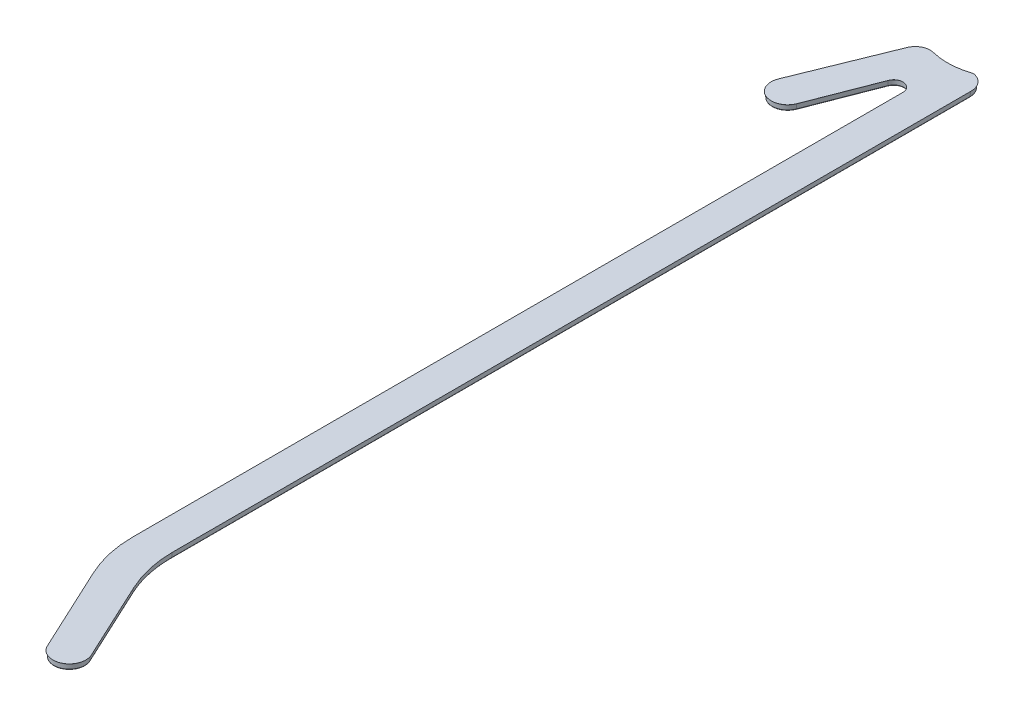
ISO-10303-21;
HEADER;
FILE_DESCRIPTION(('STEP AP214'),'2;1');
FILE_NAME('part.step','',(''),(''),'','','');
FILE_SCHEMA(('AUTOMOTIVE_DESIGN { 1 0 10303 214 1 1 1 1 }'));
ENDSEC;
DATA;
#1=APPLICATION_CONTEXT('core data for automotive mechanical design processes');
#2=APPLICATION_PROTOCOL_DEFINITION('international standard','automotive_design',2000,#1);
#3=PRODUCT_CONTEXT('',#1,'mechanical');
#4=PRODUCT('Part','Part','',(#3));
#5=PRODUCT_RELATED_PRODUCT_CATEGORY('part','',(#4));
#6=PRODUCT_DEFINITION_FORMATION('','',#4);
#7=PRODUCT_DEFINITION_CONTEXT('part definition',#1,'design');
#8=PRODUCT_DEFINITION('design','',#6,#7);
#9=PRODUCT_DEFINITION_SHAPE('','',#8);
#10=(LENGTH_UNIT() NAMED_UNIT(*) SI_UNIT(.MILLI.,.METRE.));
#11=(NAMED_UNIT(*) PLANE_ANGLE_UNIT() SI_UNIT($,.RADIAN.));
#12=(NAMED_UNIT(*) SI_UNIT($,.STERADIAN.) SOLID_ANGLE_UNIT());
#13=UNCERTAINTY_MEASURE_WITH_UNIT(LENGTH_MEASURE(1.E-05),#10,'distance_accuracy_value','');
#14=(GEOMETRIC_REPRESENTATION_CONTEXT(3) GLOBAL_UNCERTAINTY_ASSIGNED_CONTEXT((#13)) GLOBAL_UNIT_ASSIGNED_CONTEXT((#10,
#11,#12)) REPRESENTATION_CONTEXT('',''));
#15=CARTESIAN_POINT('',(0.,0.,0.));
#16=DIRECTION('',(0.,0.,1.));
#17=DIRECTION('',(1.,0.,0.));
#18=AXIS2_PLACEMENT_3D('',#15,#16,#17);
#19=CARTESIAN_POINT('',(26.,0.,204.235938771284));
#20=DIRECTION('',(0.,1.,0.));
#21=DIRECTION('',(1.,0.,0.));
#22=AXIS2_PLACEMENT_3D('',#19,#20,#21);
#23=CONICAL_SURFACE('',#22,30.,0.0523598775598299);
#24=DIRECTION('',(-0.0474324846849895,0.998629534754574,0.0221181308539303));
#25=VECTOR('',#24,1.);
#26=CARTESIAN_POINT('',(-1.1892336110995,0.,216.914486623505));
#27=LINE('',#26,#25);
#28=CARTESIAN_POINT('',(-1.12698959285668,-1.31046719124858,216.885461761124));
#29=VERTEX_POINT('',#28);
#30=CARTESIAN_POINT('',(-1.18023126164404,-0.189532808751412,216.910288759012));
#31=VERTEX_POINT('',#30);
#32=EDGE_CURVE('E395',#29,#31,#27,.T.);
#33=ORIENTED_EDGE('',*,*,#32,.T.);
#34=CARTESIAN_POINT('',(26.,-0.189532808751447,204.235938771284));
#35=DIRECTION('',(0.,-1.,0.));
#36=DIRECTION('',(1.,0.,0.));
#37=AXIS2_PLACEMENT_3D('',#34,#35,#36);
#38=CIRCLE('',#37,29.9900670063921);
#39=CARTESIAN_POINT('',(-3.99006700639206,-0.189532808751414,204.235938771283));
#40=VERTEX_POINT('',#39);
#41=EDGE_CURVE('E297',#31,#40,#38,.T.);
#42=ORIENTED_EDGE('',*,*,#41,.T.);
#43=DIRECTION('',(-0.052335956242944,0.998629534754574,0.));
#44=VECTOR('',#43,1.);
#45=CARTESIAN_POINT('',(-3.99999999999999,0.,204.235938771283));
#46=LINE('',#45,#44);
#47=CARTESIAN_POINT('',(-3.93132132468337,-1.31046719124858,204.235938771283));
#48=VERTEX_POINT('',#47);
#49=EDGE_CURVE('E474',#48,#40,#46,.T.);
#50=ORIENTED_EDGE('',*,*,#49,.F.);
#51=CARTESIAN_POINT('',(26.,-1.31046719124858,204.235938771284));
#52=DIRECTION('',(0.,1.,0.));
#53=DIRECTION('',(-1.,0.,0.));
#54=AXIS2_PLACEMENT_3D('',#51,#52,#53);
#55=CIRCLE('',#54,29.9313213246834);
#56=EDGE_CURVE('E295',#48,#29,#55,.T.);
#57=ORIENTED_EDGE('',*,*,#56,.T.);
#58=EDGE_LOOP('',(#33,#42,#50,#57));
#59=FACE_BOUND('',#58,.T.);
#60=ADVANCED_FACE('F39',(#59),#23,.T.);
#61=CARTESIAN_POINT('',(-3.99999999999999,0.,8.95774452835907));
#62=DIRECTION('',(-0.998629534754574,-0.052335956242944,0.));
#63=DIRECTION('',(0.052335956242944,-0.998629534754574,0.));
#64=AXIS2_PLACEMENT_3D('',#61,#62,#63);
#65=PLANE('',#64);
#66=ORIENTED_EDGE('',*,*,#49,.T.);
#67=DIRECTION('',(0.,0.,1.));
#68=VECTOR('',#67,1.);
#69=CARTESIAN_POINT('',(-3.99006700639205,-0.189532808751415,8.95774452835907));
#70=LINE('',#69,#68);
#71=CARTESIAN_POINT('',(-3.99006700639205,-0.189532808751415,8.95774452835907));
#72=VERTEX_POINT('',#71);
#73=EDGE_CURVE('E293',#40,#72,#70,.F.);
#74=ORIENTED_EDGE('',*,*,#73,.T.);
#75=DIRECTION('',(-0.052335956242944,0.998629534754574,0.));
#76=VECTOR('',#75,1.);
#77=CARTESIAN_POINT('',(-3.99999999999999,0.,8.95774452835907));
#78=LINE('',#77,#76);
#79=CARTESIAN_POINT('',(-3.93132132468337,-1.31046719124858,8.95774452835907));
#80=VERTEX_POINT('',#79);
#81=EDGE_CURVE('E471',#80,#72,#78,.T.);
#82=ORIENTED_EDGE('',*,*,#81,.F.);
#83=DIRECTION('',(0.,0.,1.));
#84=VECTOR('',#83,1.);
#85=CARTESIAN_POINT('',(-3.93132132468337,-1.31046719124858,8.95774452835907));
#86=LINE('',#85,#84);
#87=EDGE_CURVE('E291',#80,#48,#86,.T.);
#88=ORIENTED_EDGE('',*,*,#87,.T.);
#89=EDGE_LOOP('',(#66,#74,#82,#88));
#90=FACE_BOUND('',#89,.T.);
#91=ADVANCED_FACE('F565',(#90),#65,.T.);
#92=CARTESIAN_POINT('',(-6.49999999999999,0.,8.95774452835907));
#93=DIRECTION('',(0.,-1.,0.));
#94=DIRECTION('',(1.,0.,0.));
#95=AXIS2_PLACEMENT_3D('',#92,#93,#94);
#96=CONICAL_SURFACE('',#95,2.5,0.0523598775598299);
#97=ORIENTED_EDGE('',*,*,#81,.T.);
#98=CARTESIAN_POINT('',(-6.49999999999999,-0.189532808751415,8.95774452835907));
#99=DIRECTION('',(0.,-1.,0.));
#100=DIRECTION('',(1.,0.,0.));
#101=AXIS2_PLACEMENT_3D('',#98,#99,#100);
#102=CIRCLE('',#101,2.50993299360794);
#103=CARTESIAN_POINT('',(-8.84038695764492,-0.189532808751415,8.05090798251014));
#104=VERTEX_POINT('',#103);
#105=EDGE_CURVE('E289',#72,#104,#102,.F.);
#106=ORIENTED_EDGE('',*,*,#105,.T.);
#107=DIRECTION('',(0.0488006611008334,0.998629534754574,0.0189089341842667));
#108=VECTOR('',#107,1.);
#109=CARTESIAN_POINT('',(-8.83112493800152,0.,8.05449676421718));
#110=LINE('',#109,#108);
#111=CARTESIAN_POINT('',(-8.89516436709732,-1.31046719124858,8.0296832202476));
#112=VERTEX_POINT('',#111);
#113=EDGE_CURVE('E468',#112,#104,#110,.T.);
#114=ORIENTED_EDGE('',*,*,#113,.F.);
#115=CARTESIAN_POINT('',(-6.49999999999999,-1.31046719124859,8.95774452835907));
#116=DIRECTION('',(0.,1.,0.));
#117=DIRECTION('',(-1.,0.,0.));
#118=AXIS2_PLACEMENT_3D('',#115,#116,#117);
#119=CIRCLE('',#118,2.56867867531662);
#120=EDGE_CURVE('E287',#112,#80,#119,.F.);
#121=ORIENTED_EDGE('',*,*,#120,.T.);
#122=EDGE_LOOP('',(#97,#106,#114,#121));
#123=FACE_BOUND('',#122,.T.);
#124=ADVANCED_FACE('F570',(#123),#96,.F.);
#125=CARTESIAN_POINT('',(-8.83112493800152,0.,8.05449676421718));
#126=DIRECTION('',(0.931172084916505,-0.0523359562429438,0.360803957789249));
#127=DIRECTION('',(0.361299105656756,0.,-0.932449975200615));
#128=AXIS2_PLACEMENT_3D('',#125,#126,#127);
#129=PLANE('',#128);
#130=ORIENTED_EDGE('',*,*,#113,.T.);
#131=DIRECTION('',(-0.361299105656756,0.,0.932449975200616));
#132=VECTOR('',#131,1.);
#133=CARTESIAN_POINT('',(-8.84038695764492,-0.189532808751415,8.05090798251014));
#134=LINE('',#133,#132);
#135=CARTESIAN_POINT('',(-15.3119397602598,-0.189532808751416,24.7528570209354));
#136=VERTEX_POINT('',#135);
#137=EDGE_CURVE('E285',#104,#136,#134,.T.);
#138=ORIENTED_EDGE('',*,*,#137,.T.);
#139=DIRECTION('',(0.0488006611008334,0.998629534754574,0.0189089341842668));
#140=VECTOR('',#139,1.);
#141=CARTESIAN_POINT('',(-15.3026777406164,0.,24.7564458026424));
#142=LINE('',#141,#140);
#143=CARTESIAN_POINT('',(-15.3667171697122,-1.31046719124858,24.7316322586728));
#144=VERTEX_POINT('',#143);
#145=EDGE_CURVE('E465',#144,#136,#142,.T.);
#146=ORIENTED_EDGE('',*,*,#145,.F.);
#147=DIRECTION('',(-0.361299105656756,0.,0.932449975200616));
#148=VECTOR('',#147,1.);
#149=CARTESIAN_POINT('',(-8.89516436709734,-1.31046719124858,8.02968322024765));
#150=LINE('',#149,#148);
#151=EDGE_CURVE('E283',#144,#112,#150,.F.);
#152=ORIENTED_EDGE('',*,*,#151,.T.);
#153=EDGE_LOOP('',(#130,#138,#146,#152));
#154=FACE_BOUND('',#153,.T.);
#155=ADVANCED_FACE('F596',(#154),#129,.T.);
#156=CARTESIAN_POINT('',(-19.0324776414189,0.,23.3112493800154));
#157=DIRECTION('',(0.,1.,0.));
#158=DIRECTION('',(1.,0.,0.));
#159=AXIS2_PLACEMENT_3D('',#156,#157,#158);
#160=CONICAL_SURFACE('',#159,4.,0.0523598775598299);
#161=ORIENTED_EDGE('',*,*,#145,.T.);
#162=CARTESIAN_POINT('',(-19.0324776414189,-0.189532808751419,23.3112493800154));
#163=DIRECTION('',(0.,-1.,0.));
#164=DIRECTION('',(1.,0.,0.));
#165=AXIS2_PLACEMENT_3D('',#162,#163,#164);
#166=CIRCLE('',#165,3.99006700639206);
#167=CARTESIAN_POINT('',(-22.7304052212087,-0.189532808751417,21.812594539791));
#168=VERTEX_POINT('',#167);
#169=EDGE_CURVE('E281',#136,#168,#166,.T.);
#170=ORIENTED_EDGE('',*,*,#169,.T.);
#171=DIRECTION('',(-0.0485040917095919,0.998629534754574,-0.0196571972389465));
#172=VECTOR('',#171,1.);
#173=CARTESIAN_POINT('',(-22.7396109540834,0.,21.8088637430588));
#174=LINE('',#173,#172);
#175=CARTESIAN_POINT('',(-22.6759607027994,-1.31046719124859,21.8346592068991));
#176=VERTEX_POINT('',#175);
#177=EDGE_CURVE('E462',#176,#168,#174,.T.);
#178=ORIENTED_EDGE('',*,*,#177,.F.);
#179=CARTESIAN_POINT('',(-19.0324776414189,-1.31046719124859,23.3112493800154));
#180=DIRECTION('',(0.,1.,0.));
#181=DIRECTION('',(-1.,0.,0.));
#182=AXIS2_PLACEMENT_3D('',#179,#180,#181);
#183=CIRCLE('',#182,3.93132132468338);
#184=EDGE_CURVE('E279',#176,#144,#183,.T.);
#185=ORIENTED_EDGE('',*,*,#184,.T.);
#186=EDGE_LOOP('',(#161,#170,#178,#185));
#187=FACE_BOUND('',#186,.T.);
#188=ADVANCED_FACE('F593',(#187),#160,.T.);
#189=CARTESIAN_POINT('',(-13.3508111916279,0.,-1.35797938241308));
#190=DIRECTION('',(-0.925513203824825,-0.052335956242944,-0.375081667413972));
#191=DIRECTION('',(-0.375596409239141,0.,0.926783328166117));
#192=AXIS2_PLACEMENT_3D('',#189,#190,#191);
#193=PLANE('',#192);
#194=ORIENTED_EDGE('',*,*,#177,.T.);
#195=DIRECTION('',(-0.375596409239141,0.,0.926783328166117));
#196=VECTOR('',#195,1.);
#197=CARTESIAN_POINT('',(-13.3416054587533,-0.189532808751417,-1.35424858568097));
#198=LINE('',#197,#196);
#199=CARTESIAN_POINT('',(-13.3416054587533,-0.189532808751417,-1.35424858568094));
#200=VERTEX_POINT('',#199);
#201=EDGE_CURVE('E277',#168,#200,#198,.F.);
#202=ORIENTED_EDGE('',*,*,#201,.T.);
#203=DIRECTION('',(-0.0485040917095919,0.998629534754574,-0.0196571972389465));
#204=VECTOR('',#203,1.);
#205=CARTESIAN_POINT('',(-13.3508111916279,0.,-1.35797938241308));
#206=LINE('',#205,#204);
#207=CARTESIAN_POINT('',(-13.2871609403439,-1.31046719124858,-1.33218391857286));
#208=VERTEX_POINT('',#207);
#209=EDGE_CURVE('E459',#208,#200,#206,.T.);
#210=ORIENTED_EDGE('',*,*,#209,.F.);
#211=DIRECTION('',(-0.375596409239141,0.,0.926783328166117));
#212=VECTOR('',#211,1.);
#213=CARTESIAN_POINT('',(-13.2871609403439,-1.31046719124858,-1.33218391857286));
#214=LINE('',#213,#212);
#215=EDGE_CURVE('E275',#208,#176,#214,.T.);
#216=ORIENTED_EDGE('',*,*,#215,.T.);
#217=EDGE_LOOP('',(#194,#202,#210,#216));
#218=FACE_BOUND('',#217,.T.);
#219=ADVANCED_FACE('F514',(#218),#193,.T.);
#220=CARTESIAN_POINT('',(-10.,0.,0.));
#221=DIRECTION('',(0.,1.,0.));
#222=DIRECTION('',(1.,0.,0.));
#223=AXIS2_PLACEMENT_3D('',#220,#221,#222);
#224=CONICAL_SURFACE('',#223,3.61552812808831,0.0523598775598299);
#225=ORIENTED_EDGE('',*,*,#209,.T.);
#226=CARTESIAN_POINT('',(-10.,-0.189532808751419,0.));
#227=DIRECTION('',(0.,-1.,0.));
#228=DIRECTION('',(1.,0.,0.));
#229=AXIS2_PLACEMENT_3D('',#226,#227,#228);
#230=CIRCLE('',#229,3.60559513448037);
#231=CARTESIAN_POINT('',(-9.12551473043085,-0.189532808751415,-3.49794107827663));
#232=VERTEX_POINT('',#231);
#233=EDGE_CURVE('E273',#200,#232,#230,.T.);
#234=ORIENTED_EDGE('',*,*,#233,.T.);
#235=DIRECTION('',(0.0126933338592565,0.998629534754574,-0.0507733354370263));
#236=VECTOR('',#235,1.);
#237=CARTESIAN_POINT('',(-9.12310562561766,0.,-3.50757749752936));
#238=LINE('',#237,#236);
#239=CARTESIAN_POINT('',(-9.13976265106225,-1.31046719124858,-3.44094939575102));
#240=VERTEX_POINT('',#239);
#241=EDGE_CURVE('E454',#240,#232,#238,.T.);
#242=ORIENTED_EDGE('',*,*,#241,.F.);
#243=CARTESIAN_POINT('',(-10.,-1.31046719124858,0.));
#244=DIRECTION('',(0.,1.,0.));
#245=DIRECTION('',(-1.,0.,0.));
#246=AXIS2_PLACEMENT_3D('',#243,#244,#245);
#247=CIRCLE('',#246,3.54684945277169);
#248=EDGE_CURVE('E271',#240,#208,#247,.T.);
#249=ORIENTED_EDGE('',*,*,#248,.T.);
#250=EDGE_LOOP('',(#225,#234,#242,#249));
#251=FACE_BOUND('',#250,.T.);
#252=ADVANCED_FACE('F441',(#251),#224,.T.);
#253=CARTESIAN_POINT('',(-5.,0.,-20.));
#254=DIRECTION('',(0.,-1.,0.));
#255=DIRECTION('',(1.,0.,0.));
#256=AXIS2_PLACEMENT_3D('',#253,#254,#255);
#257=CONICAL_SURFACE('',#256,17.,0.0523598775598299);
#258=ORIENTED_EDGE('',*,*,#241,.T.);
#259=CARTESIAN_POINT('',(-5.,-0.189532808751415,-20.));
#260=DIRECTION('',(0.,-1.,0.));
#261=DIRECTION('',(1.,0.,0.));
#262=AXIS2_PLACEMENT_3D('',#259,#260,#261);
#263=CIRCLE('',#262,17.0099329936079);
#264=CARTESIAN_POINT('',(0.612697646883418,-0.189532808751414,-3.94274476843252));
#265=VERTEX_POINT('',#264);
#266=EDGE_CURVE('E269',#232,#265,#263,.F.);
#267=ORIENTED_EDGE('',*,*,#266,.T.);
#268=CARTESIAN_POINT('',(0.619041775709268,-1.49999999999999,-3.87221819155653));
#269=CARTESIAN_POINT('',(0.617849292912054,-1.25000017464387,-3.88567710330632));
#270=CARTESIAN_POINT('',(0.616646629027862,-1.0000002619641,-3.89913347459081));
#271=CARTESIAN_POINT('',(0.614220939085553,-0.5000002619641,-3.92604113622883));
#272=CARTESIAN_POINT('',(0.612997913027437,-0.250000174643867,-3.93949242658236));
#273=CARTESIAN_POINT('',(0.611764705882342,0.,-3.95294117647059));
#274=B_SPLINE_CURVE_WITH_KNOTS('',3,(#268,#269,#270,#271,#272,#273),.UNSPECIFIED.,.F.,.F.,(4,2,
4),(0.,0.751094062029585,1.50218812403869),.UNSPECIFIED.);
#275=CARTESIAN_POINT('',(0.618135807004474,-1.31046719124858,-3.88242134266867));
#276=VERTEX_POINT('',#275);
#277=EDGE_CURVE('E446',#276,#265,#274,.T.);
#278=ORIENTED_EDGE('',*,*,#277,.F.);
#279=CARTESIAN_POINT('',(-5.,-1.31046719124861,-20.));
#280=DIRECTION('',(0.,1.,0.));
#281=DIRECTION('',(-1.,0.,0.));
#282=AXIS2_PLACEMENT_3D('',#279,#280,#281);
#283=CIRCLE('',#282,17.0686786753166);
#284=EDGE_CURVE('E267',#276,#240,#283,.F.);
#285=ORIENTED_EDGE('',*,*,#284,.T.);
#286=EDGE_LOOP('',(#258,#267,#278,#285));
#287=FACE_BOUND('',#286,.T.);
#288=ADVANCED_FACE('F436',(#287),#257,.F.);
#289=CARTESIAN_POINT('',(0.,0.,0.));
#290=DIRECTION('',(0.,1.,0.));
#291=DIRECTION('',(1.,0.,0.));
#292=AXIS2_PLACEMENT_3D('',#289,#290,#291);
#293=CONICAL_SURFACE('',#292,4.,0.0523598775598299);
#294=ORIENTED_EDGE('',*,*,#277,.T.);
#295=CARTESIAN_POINT('',(0.,-0.189532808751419,0.));
#296=DIRECTION('',(0.,-1.,0.));
#297=DIRECTION('',(1.,0.,0.));
#298=AXIS2_PLACEMENT_3D('',#295,#296,#297);
#299=CIRCLE('',#298,3.99006700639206);
#300=CARTESIAN_POINT('',(3.99006700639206,-0.189532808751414,0.));
#301=VERTEX_POINT('',#300);
#302=EDGE_CURVE('E241',#265,#301,#299,.T.);
#303=ORIENTED_EDGE('',*,*,#302,.T.);
#304=DIRECTION('',(0.0523359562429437,0.998629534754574,0.));
#305=VECTOR('',#304,1.);
#306=CARTESIAN_POINT('',(4.,0.,0.));
#307=LINE('',#306,#305);
#308=CARTESIAN_POINT('',(3.93132132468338,-1.31046719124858,0.));
#309=VERTEX_POINT('',#308);
#310=EDGE_CURVE('E455',#309,#301,#307,.T.);
#311=ORIENTED_EDGE('',*,*,#310,.F.);
#312=CARTESIAN_POINT('',(0.,-1.31046719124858,0.));
#313=DIRECTION('',(0.,1.,0.));
#314=DIRECTION('',(-1.,0.,0.));
#315=AXIS2_PLACEMENT_3D('',#312,#313,#314);
#316=CIRCLE('',#315,3.93132132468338);
#317=EDGE_CURVE('E481',#309,#276,#316,.T.);
#318=ORIENTED_EDGE('',*,*,#317,.T.);
#319=EDGE_LOOP('',(#294,#303,#311,#318));
#320=FACE_BOUND('',#319,.T.);
#321=ADVANCED_FACE('F440',(#320),#293,.T.);
#322=CARTESIAN_POINT('',(4.,0.,0.));
#323=DIRECTION('',(0.998629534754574,-0.0523359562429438,0.));
#324=DIRECTION('',(0.0523359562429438,0.998629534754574,0.));
#325=AXIS2_PLACEMENT_3D('',#322,#323,#324);
#326=PLANE('',#325);
#327=ORIENTED_EDGE('',*,*,#310,.T.);
#328=DIRECTION('',(0.,0.,1.));
#329=VECTOR('',#328,1.);
#330=CARTESIAN_POINT('',(3.99006700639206,-0.189532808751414,0.));
#331=LINE('',#330,#329);
#332=CARTESIAN_POINT('',(3.99006700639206,-0.189532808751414,202.473698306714));
#333=VERTEX_POINT('',#332);
#334=EDGE_CURVE('E261',#301,#333,#331,.T.);
#335=ORIENTED_EDGE('',*,*,#334,.T.);
#336=DIRECTION('',(-0.0523324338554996,-0.998562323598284,0.011601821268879));
#337=VECTOR('',#336,1.);
#338=CARTESIAN_POINT('',(3.91735579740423,-1.57694532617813,202.489817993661));
#339=LINE('',#338,#337);
#340=CARTESIAN_POINT('',(3.93132132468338,-1.31046719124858,202.486721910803));
#341=VERTEX_POINT('',#340);
#342=EDGE_CURVE('E478',#333,#341,#339,.T.);
#343=ORIENTED_EDGE('',*,*,#342,.T.);
#344=DIRECTION('',(0.,0.,1.));
#345=VECTOR('',#344,1.);
#346=CARTESIAN_POINT('',(3.93132132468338,-1.31046719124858,0.));
#347=LINE('',#346,#345);
#348=EDGE_CURVE('E234',#341,#309,#347,.F.);
#349=ORIENTED_EDGE('',*,*,#348,.T.);
#350=EDGE_LOOP('',(#327,#335,#343,#349));
#351=FACE_BOUND('',#350,.T.);
#352=ADVANCED_FACE('F584',(#351),#326,.T.);
#353=CARTESIAN_POINT('',(4.,0.,209.113221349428));
#354=DIRECTION('',(0.905065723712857,-0.0523359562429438,-0.422039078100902));
#355=DIRECTION('',(-0.4226182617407,0.,-0.90630778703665));
#356=AXIS2_PLACEMENT_3D('',#353,#354,#355);
#357=PLANE('',#356);
#358=DIRECTION('',(0.0474324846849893,0.998629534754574,-0.0221181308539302));
#359=VECTOR('',#358,1.);
#360=CARTESIAN_POINT('',(16.3037790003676,0.,235.498760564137));
#361=LINE('',#360,#359);
#362=CARTESIAN_POINT('',(16.2415349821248,-1.31046719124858,235.527785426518));
#363=VERTEX_POINT('',#362);
#364=CARTESIAN_POINT('',(16.2947766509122,-0.189532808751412,235.502958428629));
#365=VERTEX_POINT('',#364);
#366=EDGE_CURVE('E651',#363,#365,#361,.T.);
#367=ORIENTED_EDGE('',*,*,#366,.F.);
#368=DIRECTION('',(0.4226182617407,0.,0.90630778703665));
#369=VECTOR('',#368,1.);
#370=CARTESIAN_POINT('',(6.73730501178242,-1.31046719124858,215.145898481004));
#371=LINE('',#370,#369);
#372=CARTESIAN_POINT('',(6.73823565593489,-1.31046719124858,215.14789425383));
#373=VERTEX_POINT('',#372);
#374=EDGE_CURVE('E11',#363,#373,#371,.F.);
#375=ORIENTED_EDGE('',*,*,#374,.T.);
#376=DIRECTION('',(-0.0523324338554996,-0.998562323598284,0.011601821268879));
#377=VECTOR('',#376,1.);
#378=CARTESIAN_POINT('',(6.80288179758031,-0.0769453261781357,215.133562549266));
#379=LINE('',#378,#377);
#380=CARTESIAN_POINT('',(6.79698133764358,-0.189532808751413,215.134870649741));
#381=VERTEX_POINT('',#380);
#382=EDGE_CURVE('E475',#373,#381,#379,.F.);
#383=ORIENTED_EDGE('',*,*,#382,.T.);
#384=DIRECTION('',(0.4226182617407,0.,0.90630778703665));
#385=VECTOR('',#384,1.);
#386=CARTESIAN_POINT('',(3.99099765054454,-0.189532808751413,209.117419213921));
#387=LINE('',#386,#385);
#388=EDGE_CURVE('E48',#381,#365,#387,.T.);
#389=ORIENTED_EDGE('',*,*,#388,.T.);
#390=EDGE_LOOP('',(#367,#375,#383,#389));
#391=FACE_BOUND('',#390,.T.);
#392=ADVANCED_FACE('F580',(#391),#357,.T.);
#393=CARTESIAN_POINT('',(12.678547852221,0.,237.189233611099));
#394=DIRECTION('',(0.,1.,0.));
#395=DIRECTION('',(1.,0.,0.));
#396=AXIS2_PLACEMENT_3D('',#393,#394,#395);
#397=CONICAL_SURFACE('',#396,4.,0.0523598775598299);
#398=ORIENTED_EDGE('',*,*,#366,.T.);
#399=CARTESIAN_POINT('',(12.678547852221,-0.189532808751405,237.189233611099));
#400=DIRECTION('',(0.,-1.,0.));
#401=DIRECTION('',(1.,0.,0.));
#402=AXIS2_PLACEMENT_3D('',#399,#400,#401);
#403=CIRCLE('',#402,3.99006700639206);
#404=CARTESIAN_POINT('',(9.06231905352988,-0.189532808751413,238.87550879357));
#405=VERTEX_POINT('',#404);
#406=EDGE_CURVE('E306',#365,#405,#403,.T.);
#407=ORIENTED_EDGE('',*,*,#406,.T.);
#408=DIRECTION('',(-0.0474324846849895,0.998629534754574,0.0221181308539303));
#409=VECTOR('',#408,1.);
#410=CARTESIAN_POINT('',(9.05331670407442,0.,238.879706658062));
#411=LINE('',#410,#409);
#412=CARTESIAN_POINT('',(9.11556072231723,-1.31046719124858,238.850681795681));
#413=VERTEX_POINT('',#412);
#414=EDGE_CURVE('E649',#413,#405,#411,.T.);
#415=ORIENTED_EDGE('',*,*,#414,.F.);
#416=CARTESIAN_POINT('',(12.678547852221,-1.31046719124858,237.189233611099));
#417=DIRECTION('',(0.,1.,0.));
#418=DIRECTION('',(-1.,0.,0.));
#419=AXIS2_PLACEMENT_3D('',#416,#417,#418);
#420=CIRCLE('',#419,3.93132132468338);
#421=EDGE_CURVE('E304',#413,#363,#420,.T.);
#422=ORIENTED_EDGE('',*,*,#421,.T.);
#423=EDGE_LOOP('',(#398,#407,#415,#422));
#424=FACE_BOUND('',#423,.T.);
#425=ADVANCED_FACE('F576',(#424),#397,.T.);
#426=CARTESIAN_POINT('',(-1.18923361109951,0.,216.914486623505));
#427=DIRECTION('',(-0.905065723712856,-0.052335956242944,0.422039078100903));
#428=DIRECTION('',(0.422618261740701,0.,0.906307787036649));
#429=AXIS2_PLACEMENT_3D('',#426,#427,#428);
#430=PLANE('',#429);
#431=ORIENTED_EDGE('',*,*,#414,.T.);
#432=DIRECTION('',(0.422618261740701,0.,0.906307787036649));
#433=VECTOR('',#432,1.);
#434=CARTESIAN_POINT('',(-1.18023126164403,-0.189532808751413,216.910288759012));
#435=LINE('',#434,#433);
#436=EDGE_CURVE('E302',#405,#31,#435,.F.);
#437=ORIENTED_EDGE('',*,*,#436,.T.);
#438=ORIENTED_EDGE('',*,*,#32,.F.);
#439=DIRECTION('',(0.422618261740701,0.,0.906307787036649));
#440=VECTOR('',#439,1.);
#441=CARTESIAN_POINT('',(-1.12698959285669,-1.31046719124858,216.885461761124));
#442=LINE('',#441,#440);
#443=EDGE_CURVE('E299',#29,#413,#442,.T.);
#444=ORIENTED_EDGE('',*,*,#443,.T.);
#445=EDGE_LOOP('',(#431,#437,#438,#444));
#446=FACE_BOUND('',#445,.T.);
#447=ADVANCED_FACE('F435',(#446),#430,.T.);
#448=CARTESIAN_POINT('',(26.,-1.49999999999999,204.235938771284));
#449=DIRECTION('',(0.,-1.,0.));
#450=DIRECTION('',(1.,0.,0.));
#451=AXIS2_PLACEMENT_3D('',#448,#449,#450);
#452=PLANE('',#451);
#453=CARTESIAN_POINT('',(12.678547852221,-1.49999999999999,237.189233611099));
#454=DIRECTION('',(0.,-1.,0.));
#455=DIRECTION('',(1.,0.,0.));
#456=AXIS2_PLACEMENT_3D('',#453,#454,#455);
#457=CIRCLE('',#456,3.73159541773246);
#458=CARTESIAN_POINT('',(16.0605218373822,-1.49999999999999,235.612193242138));
#459=VERTEX_POINT('',#458);
#460=CARTESIAN_POINT('',(9.2965738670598,-1.49999999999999,238.766273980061));
#461=VERTEX_POINT('',#460);
#462=EDGE_CURVE('E56',#459,#461,#457,.T.);
#463=ORIENTED_EDGE('',*,*,#462,.T.);
#464=DIRECTION('',(0.422618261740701,0.,0.906307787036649));
#465=VECTOR('',#464,1.);
#466=CARTESIAN_POINT('',(-0.945976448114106,-1.49999999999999,216.801053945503));
#467=LINE('',#466,#465);
#468=CARTESIAN_POINT('',(-0.945976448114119,-1.49999999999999,216.801053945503));
#469=VERTEX_POINT('',#468);
#470=EDGE_CURVE('E332',#461,#469,#467,.F.);
#471=ORIENTED_EDGE('',*,*,#470,.T.);
#472=CARTESIAN_POINT('',(26.,-1.49999999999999,204.235938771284));
#473=DIRECTION('',(0.,-1.,0.));
#474=DIRECTION('',(1.,0.,0.));
#475=AXIS2_PLACEMENT_3D('',#472,#473,#474);
#476=CIRCLE('',#475,29.7315954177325);
#477=CARTESIAN_POINT('',(-3.73159541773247,-1.49999999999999,204.235938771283));
#478=VERTEX_POINT('',#477);
#479=EDGE_CURVE('E308',#469,#478,#476,.T.);
#480=ORIENTED_EDGE('',*,*,#479,.T.);
#481=DIRECTION('',(0.,0.,1.));
#482=VECTOR('',#481,1.);
#483=CARTESIAN_POINT('',(-3.73159541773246,-1.49999999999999,204.235938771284));
#484=LINE('',#483,#482);
#485=CARTESIAN_POINT('',(-3.73159541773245,-1.49999999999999,8.95774452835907));
#486=VERTEX_POINT('',#485);
#487=EDGE_CURVE('E310',#478,#486,#484,.F.);
#488=ORIENTED_EDGE('',*,*,#487,.T.);
#489=CARTESIAN_POINT('',(-6.49999999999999,-1.49999999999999,8.95774452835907));
#490=DIRECTION('',(0.,-1.,0.));
#491=DIRECTION('',(1.,0.,0.));
#492=AXIS2_PLACEMENT_3D('',#489,#490,#491);
#493=CIRCLE('',#492,2.76840458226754);
#494=CARTESIAN_POINT('',(-9.08139878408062,-1.5,7.95752242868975));
#495=VERTEX_POINT('',#494);
#496=EDGE_CURVE('E312',#486,#495,#493,.F.);
#497=ORIENTED_EDGE('',*,*,#496,.T.);
#498=DIRECTION('',(0.361299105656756,0.,-0.932449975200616));
#499=VECTOR('',#498,1.);
#500=CARTESIAN_POINT('',(-15.5529515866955,-1.5,24.659471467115));
#501=LINE('',#500,#499);
#502=CARTESIAN_POINT('',(-15.5529515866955,-1.5,24.659471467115));
#503=VERTEX_POINT('',#502);
#504=EDGE_CURVE('E314',#495,#503,#501,.F.);
#505=ORIENTED_EDGE('',*,*,#504,.T.);
#506=CARTESIAN_POINT('',(-19.0324776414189,-1.5,23.3112493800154));
#507=DIRECTION('',(0.,-1.,0.));
#508=DIRECTION('',(1.,0.,0.));
#509=AXIS2_PLACEMENT_3D('',#506,#507,#508);
#510=CIRCLE('',#509,3.73159541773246);
#511=CARTESIAN_POINT('',(-22.4908580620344,-1.5,21.9096755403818));
#512=VERTEX_POINT('',#511);
#513=EDGE_CURVE('E316',#503,#512,#510,.T.);
#514=ORIENTED_EDGE('',*,*,#513,.T.);
#515=DIRECTION('',(-0.375596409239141,0.,0.926783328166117));
#516=VECTOR('',#515,1.);
#517=CARTESIAN_POINT('',(-79.1172559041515,-1.5,161.635189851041));
#518=LINE('',#517,#516);
#519=CARTESIAN_POINT('',(-13.1020582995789,-1.5,-1.25716758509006));
#520=VERTEX_POINT('',#519);
#521=EDGE_CURVE('E318',#512,#520,#518,.F.);
#522=ORIENTED_EDGE('',*,*,#521,.T.);
#523=CARTESIAN_POINT('',(-10.,-1.5,0.));
#524=DIRECTION('',(0.,-1.,0.));
#525=DIRECTION('',(1.,0.,0.));
#526=AXIS2_PLACEMENT_3D('',#523,#524,#525);
#527=CIRCLE('',#526,3.34712354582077);
#528=CARTESIAN_POINT('',(-9.18820329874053,-1.5,-3.24718680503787));
#529=VERTEX_POINT('',#528);
#530=EDGE_CURVE('E320',#520,#529,#527,.T.);
#531=ORIENTED_EDGE('',*,*,#530,.T.);
#532=CARTESIAN_POINT('',(-5.,-1.49999999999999,-20.));
#533=DIRECTION('',(0.,-1.,0.));
#534=DIRECTION('',(1.,0.,0.));
#535=AXIS2_PLACEMENT_3D('',#532,#533,#534);
#536=CIRCLE('',#535,17.2684045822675);
#537=CARTESIAN_POINT('',(0.635579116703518,-1.49999999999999,-3.6770699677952));
#538=VERTEX_POINT('',#537);
#539=EDGE_CURVE('E322',#529,#538,#536,.F.);
#540=ORIENTED_EDGE('',*,*,#539,.T.);
#541=CARTESIAN_POINT('',(0.,-1.49999999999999,0.));
#542=DIRECTION('',(0.,-1.,0.));
#543=DIRECTION('',(1.,0.,0.));
#544=AXIS2_PLACEMENT_3D('',#541,#542,#543);
#545=CIRCLE('',#544,3.73159541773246);
#546=CARTESIAN_POINT('',(3.73159541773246,-1.49999999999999,0.));
#547=VERTEX_POINT('',#546);
#548=EDGE_CURVE('E324',#538,#547,#545,.T.);
#549=ORIENTED_EDGE('',*,*,#548,.T.);
#550=DIRECTION('',(0.,0.,-1.));
#551=VECTOR('',#550,1.);
#552=CARTESIAN_POINT('',(3.73159541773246,-1.49999999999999,202.488924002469));
#553=LINE('',#552,#551);
#554=CARTESIAN_POINT('',(3.73159541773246,-1.49999999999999,202.486721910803));
#555=VERTEX_POINT('',#554);
#556=EDGE_CURVE('E326',#547,#555,#553,.F.);
#557=ORIENTED_EDGE('',*,*,#556,.T.);
#558=CARTESIAN_POINT('',(33.9730402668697,-1.49999999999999,202.468358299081));
#559=DIRECTION('',(0.,-1.,0.));
#560=DIRECTION('',(-0.976296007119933,0.,0.216439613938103));
#561=AXIS2_PLACEMENT_3D('',#558,#559,#560);
#562=ELLIPSE('',#561,30.2434803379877,30.2);
#563=CARTESIAN_POINT('',(6.55722251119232,-1.49999999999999,215.23230206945));
#564=VERTEX_POINT('',#563);
#565=EDGE_CURVE('E328',#555,#564,#562,.F.);
#566=ORIENTED_EDGE('',*,*,#565,.T.);
#567=DIRECTION('',(-0.4226182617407,0.,-0.90630778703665));
#568=VECTOR('',#567,1.);
#569=CARTESIAN_POINT('',(16.0605218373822,-1.49999999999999,235.612193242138));
#570=LINE('',#569,#568);
#571=EDGE_CURVE('E61',#564,#459,#570,.F.);
#572=ORIENTED_EDGE('',*,*,#571,.T.);
#573=EDGE_LOOP('',(#463,#471,#480,#488,#497,#505,#514,#522,#531,#540,#549,#557,#566,#572));
#574=FACE_BOUND('',#573,.T.);
#575=ADVANCED_FACE('F430',(#574),#452,.T.);
#576=CARTESIAN_POINT('',(33.954853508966,-1.64702401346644,202.472390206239));
#577=DIRECTION('',(-0.0523324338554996,-0.998562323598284,0.011601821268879));
#578=DIRECTION('',(0.998629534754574,-0.0523359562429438,0.));
#579=AXIS2_PLACEMENT_3D('',#576,#577,#578);
#580=CYLINDRICAL_SURFACE('',#579,30.);
#581=ORIENTED_EDGE('',*,*,#342,.F.);
#582=CARTESIAN_POINT('',(34.030688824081,-0.199999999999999,202.455577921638));
#583=DIRECTION('',(0.000348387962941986,0.999999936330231,-7.72357519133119E-05));
#584=DIRECTION('',(-0.976295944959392,0.000356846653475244,0.216439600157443));
#585=AXIS2_PLACEMENT_3D('',#582,#583,#584);
#586=ELLIPSE('',#585,30.0426188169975,30.);
#587=EDGE_CURVE('E265',#333,#381,#586,.T.);
#588=ORIENTED_EDGE('',*,*,#587,.T.);
#589=ORIENTED_EDGE('',*,*,#382,.F.);
#590=CARTESIAN_POINT('',(33.9730402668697,-1.29999999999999,202.468358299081));
#591=DIRECTION('',(-0.000348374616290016,0.999999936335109,7.72327930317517E-05));
#592=DIRECTION('',(-0.976295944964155,-0.000356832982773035,0.216439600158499));
#593=AXIS2_PLACEMENT_3D('',#590,#591,#592);
#594=ELLIPSE('',#593,30.0437697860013,30.);
#595=EDGE_CURVE('E263',#373,#341,#594,.F.);
#596=ORIENTED_EDGE('',*,*,#595,.T.);
#597=EDGE_LOOP('',(#581,#588,#589,#596));
#598=FACE_BOUND('',#597,.T.);
#599=ADVANCED_FACE('F362',(#598),#580,.F.);
#600=CARTESIAN_POINT('',(-4.18979291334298,-0.200000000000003,300.));
#601=DIRECTION('',(0.,0.,-1.));
#602=DIRECTION('',(-1.,0.,0.));
#603=AXIS2_PLACEMENT_3D('',#600,#601,#602);
#604=CYLINDRICAL_SURFACE('',#603,0.2);
#605=CARTESIAN_POINT('',(-4.18979291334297,-0.200000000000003,204.235938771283));
#606=DIRECTION('',(0.,0.,-1.));
#607=DIRECTION('',(-1.,0.,0.));
#608=AXIS2_PLACEMENT_3D('',#605,#606,#607);
#609=CIRCLE('',#608,0.2);
#610=CARTESIAN_POINT('',(-4.18979291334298,0.,204.235938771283));
#611=VERTEX_POINT('',#610);
#612=EDGE_CURVE('E389',#611,#40,#609,.T.);
#613=ORIENTED_EDGE('',*,*,#612,.F.);
#614=DIRECTION('',(0.,0.,1.));
#615=VECTOR('',#614,1.);
#616=CARTESIAN_POINT('',(-4.18979291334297,0.,204.235938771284));
#617=LINE('',#616,#615);
#618=CARTESIAN_POINT('',(-4.18979291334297,0.,8.95774452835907));
#619=VERTEX_POINT('',#618);
#620=EDGE_CURVE('E492',#619,#611,#617,.T.);
#621=ORIENTED_EDGE('',*,*,#620,.F.);
#622=CARTESIAN_POINT('',(-4.18979291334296,-0.200000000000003,8.95774452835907));
#623=DIRECTION('',(0.,0.,1.));
#624=DIRECTION('',(1.,0.,0.));
#625=AXIS2_PLACEMENT_3D('',#622,#623,#624);
#626=CIRCLE('',#625,0.2);
#627=EDGE_CURVE('E392',#72,#619,#626,.T.);
#628=ORIENTED_EDGE('',*,*,#627,.F.);
#629=ORIENTED_EDGE('',*,*,#73,.F.);
#630=EDGE_LOOP('',(#613,#621,#628,#629));
#631=FACE_BOUND('',#630,.T.);
#632=ADVANCED_FACE('F615',(#631),#604,.F.);
#633=CARTESIAN_POINT('',(-6.49999999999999,-0.200000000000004,8.95774452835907));
#634=DIRECTION('',(0.,-1.,0.));
#635=DIRECTION('',(1.,0.,0.));
#636=AXIS2_PLACEMENT_3D('',#633,#634,#635);
#637=TOROIDAL_SURFACE('',#636,2.31020708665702,0.2);
#638=ORIENTED_EDGE('',*,*,#627,.T.);
#639=CARTESIAN_POINT('',(-6.49999999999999,0.,8.95774452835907));
#640=DIRECTION('',(0.,-1.,0.));
#641=DIRECTION('',(1.,0.,0.));
#642=AXIS2_PLACEMENT_3D('',#639,#640,#641);
#643=CIRCLE('',#642,2.31020708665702);
#644=CARTESIAN_POINT('',(-8.65415254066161,0.,8.12306877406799));
#645=VERTEX_POINT('',#644);
#646=EDGE_CURVE('E494',#645,#619,#643,.T.);
#647=ORIENTED_EDGE('',*,*,#646,.F.);
#648=CARTESIAN_POINT('',(-8.65415254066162,-0.200000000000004,8.12306877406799));
#649=DIRECTION('',(0.361299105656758,0.,-0.932449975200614));
#650=DIRECTION('',(-0.932449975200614,0.,-0.361299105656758));
#651=AXIS2_PLACEMENT_3D('',#648,#649,#650);
#652=CIRCLE('',#651,0.2);
#653=EDGE_CURVE('E386',#104,#645,#652,.T.);
#654=ORIENTED_EDGE('',*,*,#653,.F.);
#655=ORIENTED_EDGE('',*,*,#105,.F.);
#656=EDGE_LOOP('',(#638,#647,#654,#655));
#657=FACE_BOUND('',#656,.T.);
#658=ADVANCED_FACE('F619',(#657),#637,.F.);
#659=CARTESIAN_POINT('',(26.,-0.2,204.235938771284));
#660=DIRECTION('',(0.,-1.,0.));
#661=DIRECTION('',(1.,0.,0.));
#662=AXIS2_PLACEMENT_3D('',#659,#660,#661);
#663=TOROIDAL_SURFACE('',#662,30.189792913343,0.2);
#664=ORIENTED_EDGE('',*,*,#612,.T.);
#665=ORIENTED_EDGE('',*,*,#41,.F.);
#666=CARTESIAN_POINT('',(-1.3612444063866,-0.200000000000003,216.994696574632));
#667=DIRECTION('',(-0.422618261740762,0.,-0.906307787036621));
#668=DIRECTION('',(-0.906307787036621,0.,0.422618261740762));
#669=AXIS2_PLACEMENT_3D('',#666,#667,#668);
#670=CIRCLE('',#669,0.2);
#671=CARTESIAN_POINT('',(-1.36124440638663,0.,216.994696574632));
#672=VERTEX_POINT('',#671);
#673=EDGE_CURVE('E383',#672,#31,#670,.T.);
#674=ORIENTED_EDGE('',*,*,#673,.F.);
#675=CARTESIAN_POINT('',(26.,0.,204.235938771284));
#676=DIRECTION('',(0.,-1.,0.));
#677=DIRECTION('',(1.,0.,0.));
#678=AXIS2_PLACEMENT_3D('',#675,#676,#677);
#679=CIRCLE('',#678,30.189792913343);
#680=EDGE_CURVE('E490',#611,#672,#679,.F.);
#681=ORIENTED_EDGE('',*,*,#680,.F.);
#682=EDGE_LOOP('',(#664,#665,#674,#681));
#683=FACE_BOUND('',#682,.T.);
#684=ADVANCED_FACE('F703',(#683),#663,.F.);
#685=CARTESIAN_POINT('',(-8.65415254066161,-0.200000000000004,8.12306877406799));
#686=DIRECTION('',(0.361299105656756,0.,-0.932449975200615));
#687=DIRECTION('',(-0.932449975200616,0.,-0.361299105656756));
#688=AXIS2_PLACEMENT_3D('',#685,#686,#687);
#689=CYLINDRICAL_SURFACE('',#688,0.2);
#690=ORIENTED_EDGE('',*,*,#653,.T.);
#691=DIRECTION('',(0.361299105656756,0.,-0.932449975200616));
#692=VECTOR('',#691,1.);
#693=CARTESIAN_POINT('',(-100.634378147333,0.,245.507988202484));
#694=LINE('',#693,#692);
#695=CARTESIAN_POINT('',(-15.1257053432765,0.,24.8250178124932));
#696=VERTEX_POINT('',#695);
#697=EDGE_CURVE('E496',#696,#645,#694,.T.);
#698=ORIENTED_EDGE('',*,*,#697,.F.);
#699=CARTESIAN_POINT('',(-15.1257053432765,-0.200000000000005,24.8250178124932));
#700=DIRECTION('',(0.361299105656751,0.,-0.932449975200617));
#701=DIRECTION('',(-0.932449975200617,0.,-0.361299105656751));
#702=AXIS2_PLACEMENT_3D('',#699,#700,#701);
#703=CIRCLE('',#702,0.2);
#704=EDGE_CURVE('E380',#136,#696,#703,.T.);
#705=ORIENTED_EDGE('',*,*,#704,.F.);
#706=ORIENTED_EDGE('',*,*,#137,.F.);
#707=EDGE_LOOP('',(#690,#698,#705,#706));
#708=FACE_BOUND('',#707,.T.);
#709=ADVANCED_FACE('F622',(#708),#689,.F.);
#710=CARTESIAN_POINT('',(37.8190058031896,-0.199999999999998,301.017014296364));
#711=DIRECTION('',(-0.422618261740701,0.,-0.906307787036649));
#712=DIRECTION('',(-0.906307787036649,0.,0.422618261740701));
#713=AXIS2_PLACEMENT_3D('',#710,#711,#712);
#714=CYLINDRICAL_SURFACE('',#713,0.2);
#715=ORIENTED_EDGE('',*,*,#673,.T.);
#716=ORIENTED_EDGE('',*,*,#436,.F.);
#717=CARTESIAN_POINT('',(8.88130590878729,-0.200000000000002,238.95991660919));
#718=DIRECTION('',(-0.422618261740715,0.,-0.906307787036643));
#719=DIRECTION('',(-0.906307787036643,0.,0.422618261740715));
#720=AXIS2_PLACEMENT_3D('',#717,#718,#719);
#721=CIRCLE('',#720,0.2);
#722=CARTESIAN_POINT('',(8.8813059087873,0.,238.95991660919));
#723=VERTEX_POINT('',#722);
#724=EDGE_CURVE('E377',#723,#405,#721,.T.);
#725=ORIENTED_EDGE('',*,*,#724,.F.);
#726=DIRECTION('',(0.422618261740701,0.,0.906307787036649));
#727=VECTOR('',#726,1.);
#728=CARTESIAN_POINT('',(8.88130590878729,0.,238.95991660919));
#729=LINE('',#728,#727);
#730=EDGE_CURVE('E488',#672,#723,#729,.T.);
#731=ORIENTED_EDGE('',*,*,#730,.F.);
#732=EDGE_LOOP('',(#715,#716,#725,#731));
#733=FACE_BOUND('',#732,.T.);
#734=ADVANCED_FACE('F701',(#733),#714,.F.);
#735=CARTESIAN_POINT('',(-19.0324776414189,-0.200000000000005,23.3112493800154));
#736=DIRECTION('',(0.,-1.,0.));
#737=DIRECTION('',(1.,0.,0.));
#738=AXIS2_PLACEMENT_3D('',#735,#736,#737);
#739=TOROIDAL_SURFACE('',#738,4.18979291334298,0.2);
#740=ORIENTED_EDGE('',*,*,#704,.T.);
#741=CARTESIAN_POINT('',(-19.0324776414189,0.,23.3112493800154));
#742=DIRECTION('',(0.,-1.,0.));
#743=DIRECTION('',(1.,0.,0.));
#744=AXIS2_PLACEMENT_3D('',#741,#742,#743);
#745=CIRCLE('',#744,4.18979291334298);
#746=CARTESIAN_POINT('',(-22.9155078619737,0.,21.7375782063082));
#747=VERTEX_POINT('',#746);
#748=EDGE_CURVE('E498',#747,#696,#745,.F.);
#749=ORIENTED_EDGE('',*,*,#748,.F.);
#750=CARTESIAN_POINT('',(-22.9155078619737,-0.200000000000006,21.7375782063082));
#751=DIRECTION('',(-0.37559640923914,0.,0.926783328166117));
#752=DIRECTION('',(0.926783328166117,0.,0.37559640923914));
#753=AXIS2_PLACEMENT_3D('',#750,#751,#752);
#754=CIRCLE('',#753,0.2);
#755=EDGE_CURVE('E374',#168,#747,#754,.T.);
#756=ORIENTED_EDGE('',*,*,#755,.F.);
#757=ORIENTED_EDGE('',*,*,#169,.F.);
#758=EDGE_LOOP('',(#740,#749,#756,#757));
#759=FACE_BOUND('',#758,.T.);
#760=ADVANCED_FACE('F506',(#759),#739,.F.);
#761=CARTESIAN_POINT('',(12.678547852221,-0.200000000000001,237.189233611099));
#762=DIRECTION('',(0.,-1.,0.));
#763=DIRECTION('',(1.,0.,0.));
#764=AXIS2_PLACEMENT_3D('',#761,#762,#763);
#765=TOROIDAL_SURFACE('',#764,4.18979291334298,0.2);
#766=ORIENTED_EDGE('',*,*,#724,.T.);
#767=ORIENTED_EDGE('',*,*,#406,.F.);
#768=CARTESIAN_POINT('',(16.4757897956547,-0.200000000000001,235.418550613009));
#769=DIRECTION('',(0.422618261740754,0.,0.906307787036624));
#770=DIRECTION('',(0.906307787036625,0.,-0.422618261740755));
#771=AXIS2_PLACEMENT_3D('',#768,#769,#770);
#772=CIRCLE('',#771,0.2);
#773=CARTESIAN_POINT('',(16.4757897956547,0.,235.418550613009));
#774=VERTEX_POINT('',#773);
#775=EDGE_CURVE('E371',#774,#365,#772,.T.);
#776=ORIENTED_EDGE('',*,*,#775,.F.);
#777=CARTESIAN_POINT('',(12.678547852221,0.,237.189233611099));
#778=DIRECTION('',(0.,-1.,0.));
#779=DIRECTION('',(1.,0.,0.));
#780=AXIS2_PLACEMENT_3D('',#777,#778,#779);
#781=CIRCLE('',#780,4.18979291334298);
#782=EDGE_CURVE('E486',#723,#774,#781,.F.);
#783=ORIENTED_EDGE('',*,*,#782,.F.);
#784=EDGE_LOOP('',(#766,#767,#776,#783));
#785=FACE_BOUND('',#784,.T.);
#786=ADVANCED_FACE('F686',(#785),#765,.F.);
#787=CARTESIAN_POINT('',(-110.90202202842,-0.200000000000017,238.844111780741));
#788=DIRECTION('',(0.375596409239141,0.,-0.926783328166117));
#789=DIRECTION('',(-0.926783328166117,0.,-0.375596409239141));
#790=AXIS2_PLACEMENT_3D('',#787,#788,#789);
#791=CYLINDRICAL_SURFACE('',#790,0.2);
#792=ORIENTED_EDGE('',*,*,#755,.T.);
#793=DIRECTION('',(-0.375596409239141,0.,0.926783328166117));
#794=VECTOR('',#793,1.);
#795=CARTESIAN_POINT('',(-22.9155078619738,0.,21.7375782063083));
#796=LINE('',#795,#794);
#797=CARTESIAN_POINT('',(-13.5267080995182,0.,-1.42926491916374));
#798=VERTEX_POINT('',#797);
#799=EDGE_CURVE('E255',#798,#747,#796,.T.);
#800=ORIENTED_EDGE('',*,*,#799,.F.);
#801=CARTESIAN_POINT('',(-13.5267080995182,-0.200000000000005,-1.42926491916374));
#802=DIRECTION('',(-0.375596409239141,0.,0.926783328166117));
#803=DIRECTION('',(0.926783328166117,0.,0.375596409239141));
#804=AXIS2_PLACEMENT_3D('',#801,#802,#803);
#805=CIRCLE('',#804,0.2);
#806=EDGE_CURVE('E368',#200,#798,#805,.T.);
#807=ORIENTED_EDGE('',*,*,#806,.F.);
#808=ORIENTED_EDGE('',*,*,#201,.F.);
#809=EDGE_LOOP('',(#792,#800,#807,#808));
#810=FACE_BOUND('',#809,.T.);
#811=ADVANCED_FACE('F510',(#810),#791,.F.);
#812=CARTESIAN_POINT('',(4.17201079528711,-0.200000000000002,209.0330113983));
#813=DIRECTION('',(-0.4226182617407,0.,-0.90630778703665));
#814=DIRECTION('',(-0.90630778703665,0.,0.4226182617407));
#815=AXIS2_PLACEMENT_3D('',#812,#813,#814);
#816=CYLINDRICAL_SURFACE('',#815,0.2);
#817=ORIENTED_EDGE('',*,*,#775,.T.);
#818=ORIENTED_EDGE('',*,*,#388,.F.);
#819=CARTESIAN_POINT('',(6.97799448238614,-0.200000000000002,215.050462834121));
#820=DIRECTION('',(0.422618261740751,0.,0.906307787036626));
#821=DIRECTION('',(0.906307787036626,0.,-0.422618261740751));
#822=AXIS2_PLACEMENT_3D('',#819,#820,#821);
#823=CIRCLE('',#822,0.2);
#824=CARTESIAN_POINT('',(6.97799448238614,0.,215.050462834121));
#825=VERTEX_POINT('',#824);
#826=EDGE_CURVE('E367',#825,#381,#823,.T.);
#827=ORIENTED_EDGE('',*,*,#826,.F.);
#828=DIRECTION('',(-0.4226182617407,0.,-0.90630778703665));
#829=VECTOR('',#828,1.);
#830=CARTESIAN_POINT('',(45.413489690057,0.,297.475648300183));
#831=LINE('',#830,#829);
#832=EDGE_CURVE('E484',#774,#825,#831,.T.);
#833=ORIENTED_EDGE('',*,*,#832,.F.);
#834=EDGE_LOOP('',(#817,#818,#827,#833));
#835=FACE_BOUND('',#834,.T.);
#836=ADVANCED_FACE('F692',(#835),#816,.F.);
#837=CARTESIAN_POINT('',(-10.,-0.200000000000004,0.));
#838=DIRECTION('',(0.,-1.,0.));
#839=DIRECTION('',(1.,0.,0.));
#840=AXIS2_PLACEMENT_3D('',#837,#838,#839);
#841=TOROIDAL_SURFACE('',#840,3.80532104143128,0.2);
#842=ORIENTED_EDGE('',*,*,#806,.T.);
#843=CARTESIAN_POINT('',(-10.,0.,0.));
#844=DIRECTION('',(0.,-1.,0.));
#845=DIRECTION('',(1.,0.,0.));
#846=AXIS2_PLACEMENT_3D('',#843,#844,#845);
#847=CIRCLE('',#846,3.80532104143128);
#848=CARTESIAN_POINT('',(-9.07707408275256,0.,-3.69170366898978));
#849=VERTEX_POINT('',#848);
#850=EDGE_CURVE('E252',#849,#798,#847,.F.);
#851=ORIENTED_EDGE('',*,*,#850,.F.);
#852=CARTESIAN_POINT('',(-9.07707408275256,-0.200000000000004,-3.69170366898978));
#853=DIRECTION('',(-0.970142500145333,0.,-0.24253562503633));
#854=DIRECTION('',(-0.24253562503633,0.,0.970142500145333));
#855=AXIS2_PLACEMENT_3D('',#852,#853,#854);
#856=CIRCLE('',#855,0.2);
#857=EDGE_CURVE('E250',#232,#849,#856,.T.);
#858=ORIENTED_EDGE('',*,*,#857,.F.);
#859=ORIENTED_EDGE('',*,*,#233,.F.);
#860=EDGE_LOOP('',(#842,#851,#858,#859));
#861=FACE_BOUND('',#860,.T.);
#862=ADVANCED_FACE('F357',(#861),#841,.F.);
#863=CARTESIAN_POINT('',(4.89518037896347,0.,208.914764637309));
#864=CARTESIAN_POINT('',(4.71012160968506,0.,208.955791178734));
#865=CARTESIAN_POINT('',(4.70020189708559,-0.189279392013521,208.957990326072));
#866=CARTESIAN_POINT('',(4.61374854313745,0.,207.645307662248));
#867=CARTESIAN_POINT('',(4.42689723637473,0.,207.678248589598));
#868=CARTESIAN_POINT('',(4.41688125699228,-0.189279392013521,207.68001350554));
#869=CARTESIAN_POINT('',(4.41564317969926,0.,206.357377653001));
#870=CARTESIAN_POINT('',(4.22748463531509,0.,206.381930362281));
#871=CARTESIAN_POINT('',(4.21744472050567,-0.18931005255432,206.383440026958));
#872=CARTESIAN_POINT('',(4.18946679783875,0.,203.766610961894));
#873=CARTESIAN_POINT('',(3.99975121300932,0.,203.774665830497));
#874=CARTESIAN_POINT('',(3.98974397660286,-0.189432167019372,203.775287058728));
#875=CARTESIAN_POINT('',(4.16140405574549,0.,202.463773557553));
#876=CARTESIAN_POINT('',(3.97145545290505,0.,202.463338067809));
#877=CARTESIAN_POINT('',(3.96148810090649,-0.189523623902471,202.463706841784));
#878=CARTESIAN_POINT('',(4.27578465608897,0.,199.865484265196));
#879=CARTESIAN_POINT('',(4.08633501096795,0.,199.848463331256));
#880=CARTESIAN_POINT('',(4.07662366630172,-0.189765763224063,199.847982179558));
#881=CARTESIAN_POINT('',(4.41824402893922,0.,198.570033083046));
#882=CARTESIAN_POINT('',(4.22964142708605,0.,198.544552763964));
#883=CARTESIAN_POINT('',(4.22003124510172,-0.189916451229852,198.543838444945));
#884=CARTESIAN_POINT('',(4.87122376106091,0.,196.008679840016));
#885=CARTESIAN_POINT('',(4.68517954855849,0.,195.966768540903));
#886=CARTESIAN_POINT('',(4.67603234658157,-0.190274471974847,195.965299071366));
#887=CARTESIAN_POINT('',(5.18176645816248,0.,194.742781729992));
#888=CARTESIAN_POINT('',(4.99763964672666,0.,194.692575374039));
#889=CARTESIAN_POINT('',(4.9886483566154,-0.190481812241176,194.69090740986));
#890=CARTESIAN_POINT('',(5.96559354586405,0.,192.262190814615));
#891=CARTESIAN_POINT('',(5.78606276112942,0.,192.195951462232));
#892=CARTESIAN_POINT('',(5.77771151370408,-0.190949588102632,192.193673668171));
#893=CARTESIAN_POINT('',(6.43890441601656,0.,191.047506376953));
#894=CARTESIAN_POINT('',(6.26233606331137,0.,190.973268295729));
#895=CARTESIAN_POINT('',(6.25418531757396,-0.191210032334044,190.97084001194));
#896=CARTESIAN_POINT('',(7.54016597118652,0.,188.69012169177));
#897=CARTESIAN_POINT('',(7.3701834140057,0.,188.600491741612));
#898=CARTESIAN_POINT('',(7.36280804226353,-0.191779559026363,188.597640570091));
#899=CARTESIAN_POINT('',(8.16814470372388,0.,187.547434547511));
#900=CARTESIAN_POINT('',(8.00212869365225,0.,187.450231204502));
#901=CARTESIAN_POINT('',(7.99498519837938,-0.192088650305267,187.44728797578));
#902=CARTESIAN_POINT('',(9.56799643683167,0.,185.353591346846));
#903=CARTESIAN_POINT('',(9.41048111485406,0.,185.241877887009));
#904=CARTESIAN_POINT('',(9.40419724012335,-0.19275018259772,185.238728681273));
#905=CARTESIAN_POINT('',(10.3398964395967,0.,184.302452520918));
#906=CARTESIAN_POINT('',(10.1872954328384,0.,184.183715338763));
#907=CARTESIAN_POINT('',(10.1812593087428,-0.193102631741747,184.180539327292));
#908=CARTESIAN_POINT('',(12.014385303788,0.,182.309687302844));
#909=CARTESIAN_POINT('',(11.8720970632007,0.,182.177557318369));
#910=CARTESIAN_POINT('',(11.8669474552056,-0.193844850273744,182.174408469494));
#911=CARTESIAN_POINT('',(12.9169978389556,0.,181.368080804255));
#912=CARTESIAN_POINT('',(12.7805002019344,0.,181.229594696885));
#913=CARTESIAN_POINT('',(12.7755973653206,-0.194234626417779,181.226486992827));
#914=CARTESIAN_POINT('',(14.8374720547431,0.,179.610489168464));
#915=CARTESIAN_POINT('',(14.7129676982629,0.,179.459955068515));
#916=CARTESIAN_POINT('',(14.7089182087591,-0.19504483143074,179.457108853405));
#917=CARTESIAN_POINT('',(15.8553524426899,0.,178.794524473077));
#918=CARTESIAN_POINT('',(15.7374288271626,0.,178.638411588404));
#919=CARTESIAN_POINT('',(15.7336079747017,-0.195465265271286,178.635672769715));
#920=CARTESIAN_POINT('',(17.9889518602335,0.,177.302177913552));
#921=CARTESIAN_POINT('',(17.8845411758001,0.,177.135577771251));
#922=CARTESIAN_POINT('',(17.8814815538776,-0.196329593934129,177.133320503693));
#923=CARTESIAN_POINT('',(19.1046838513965,0.,176.625814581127));
#924=CARTESIAN_POINT('',(19.0075438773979,0.,176.454512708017));
#925=CARTESIAN_POINT('',(19.0046784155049,-0.196773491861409,176.452422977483));
#926=CARTESIAN_POINT('',(21.4149022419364,0.,175.424246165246));
#927=CARTESIAN_POINT('',(21.3326045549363,0.,175.244218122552));
#928=CARTESIAN_POINT('',(21.330354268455,-0.197677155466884,175.242800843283));
#929=CARTESIAN_POINT('',(22.6093960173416,0.,174.899055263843));
#930=CARTESIAN_POINT('',(22.5349457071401,0.,174.7152903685));
#931=CARTESIAN_POINT('',(22.5328406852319,-0.198136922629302,174.714090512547));
#932=CARTESIAN_POINT('',(25.0567056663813,0.,174.008822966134));
#933=CARTESIAN_POINT('',(24.9982077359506,0.,173.818273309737));
#934=CARTESIAN_POINT('',(24.9965266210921,-0.199064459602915,173.817894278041));
#935=CARTESIAN_POINT('',(26.3095243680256,0.,173.643789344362));
#936=CARTESIAN_POINT('',(26.2593251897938,0.,173.450541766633));
#937=CARTESIAN_POINT('',(26.2577289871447,-0.199532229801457,173.45041620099));
#938=CARTESIAN_POINT('',(28.8520522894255,0.,173.080124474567));
#939=CARTESIAN_POINT('',(28.8186685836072,0.,172.882189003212));
#940=CARTESIAN_POINT('',(28.8172718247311,-0.200467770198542,172.882979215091));
#941=CARTESIAN_POINT('',(30.1417615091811,0.,172.881493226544));
#942=CARTESIAN_POINT('',(30.1169921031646,0.,172.681957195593));
#943=CARTESIAN_POINT('',(30.115612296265,-0.200935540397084,172.683020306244));
#944=CARTESIAN_POINT('',(32.7360057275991,0.,172.654039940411));
#945=CARTESIAN_POINT('',(32.7286423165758,0.,172.452038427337));
#946=CARTESIAN_POINT('',(32.7272189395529,-0.201863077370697,172.4540512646));
#947=CARTESIAN_POINT('',(34.0405400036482,0.,172.625209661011));
#948=CARTESIAN_POINT('',(34.0419618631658,0.,172.422745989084));
#949=CARTESIAN_POINT('',(34.0404843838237,-0.202322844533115,172.425032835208));
#950=CARTESIAN_POINT('',(36.6421136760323,0.,172.737859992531));
#951=CARTESIAN_POINT('',(36.6612371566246,0.,172.535243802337));
#952=CARTESIAN_POINT('',(36.6594709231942,-0.20322650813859,172.53844970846));
#953=CARTESIAN_POINT('',(37.9391537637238,0.,172.879324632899));
#954=CARTESIAN_POINT('',(37.9670823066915,0.,172.677406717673));
#955=CARTESIAN_POINT('',(37.9651927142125,-0.20367040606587,172.680868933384));
#956=CARTESIAN_POINT('',(40.5035444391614,0.,173.330151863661));
#957=CARTESIAN_POINT('',(40.5491574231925,0.,173.13044510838));
#958=CARTESIAN_POINT('',(40.5467487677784,-0.204534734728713,173.134731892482));
#959=CARTESIAN_POINT('',(41.7708989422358,0.,173.639492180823));
#960=CARTESIAN_POINT('',(41.8251815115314,0.,173.441645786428));
#961=CARTESIAN_POINT('',(41.8225869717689,-0.204955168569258,173.446153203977));
#962=CARTESIAN_POINT('',(44.254230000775,0.,174.420783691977));
#963=CARTESIAN_POINT('',(44.325854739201,0.,174.227518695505));
#964=CARTESIAN_POINT('',(44.3225422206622,-0.20576537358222,174.232697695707));
#965=CARTESIAN_POINT('',(45.4702148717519,0.,174.892708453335));
#966=CARTESIAN_POINT('',(45.5502172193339,0.,174.702446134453));
#967=CARTESIAN_POINT('',(45.5466676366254,-0.206155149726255,174.707794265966));
#968=CARTESIAN_POINT('',(47.8299961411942,0.,175.991097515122));
#969=CARTESIAN_POINT('',(47.9266677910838,0.,175.807745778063));
#970=CARTESIAN_POINT('',(47.9222474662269,-0.206897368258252,175.813563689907));
#971=CARTESIAN_POINT('',(48.9738055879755,0.,176.617533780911));
#972=CARTESIAN_POINT('',(49.0784083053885,0.,176.438285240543));
#973=CARTESIAN_POINT('',(49.0737150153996,-0.207249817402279,176.444208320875));
#974=CARTESIAN_POINT('',(51.1696603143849,0.,178.014228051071));
#975=CARTESIAN_POINT('',(51.2899311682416,0.,177.844128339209));
#976=CARTESIAN_POINT('',(51.2842723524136,-0.207911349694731,177.850284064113));
#977=CARTESIAN_POINT('',(52.221722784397,0.,178.784459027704));
#978=CARTESIAN_POINT('',(52.3493289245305,0.,178.619499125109));
#979=CARTESIAN_POINT('',(52.3433794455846,-0.208220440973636,178.625687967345));
#980=CARTESIAN_POINT('',(54.2160785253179,0.,180.455561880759));
#981=CARTESIAN_POINT('',(54.3580342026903,0.,180.30184746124));
#982=CARTESIAN_POINT('',(54.3510902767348,-0.208789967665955,180.308012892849));
#983=CARTESIAN_POINT('',(55.1583916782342,0.,181.356410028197));
#984=CARTESIAN_POINT('',(55.3069464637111,0.,181.208786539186));
#985=CARTESIAN_POINT('',(55.2997140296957,-0.209050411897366,181.214910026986));
#986=CARTESIAN_POINT('',(56.9171232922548,0.,183.273329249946));
#987=CARTESIAN_POINT('',(57.0784114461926,0.,183.138856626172));
#988=CARTESIAN_POINT('',(57.0702246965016,-0.209518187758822,183.144699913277));
#989=CARTESIAN_POINT('',(57.7335622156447,0.,184.28938154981));
#990=CARTESIAN_POINT('',(57.9005852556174,0.,184.161845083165));
#991=CARTESIAN_POINT('',(57.8921322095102,-0.209725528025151,184.167573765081));
#992=CARTESIAN_POINT('',(59.2265759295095,0.,186.419318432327));
#993=CARTESIAN_POINT('',(59.4044474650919,0.,186.306600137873));
#994=CARTESIAN_POINT('',(59.3951473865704,-0.210083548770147,186.311809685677));
#995=CARTESIAN_POINT('',(59.9031692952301,0.,187.533189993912));
#996=CARTESIAN_POINT('',(60.0857991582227,0.,187.428128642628));
#997=CARTESIAN_POINT('',(60.0762737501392,-0.210234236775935,187.433158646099));
#998=CARTESIAN_POINT('',(61.1049178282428,0.,189.839700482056));
#999=CARTESIAN_POINT('',(61.296280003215,0.,189.750844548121));
#1000=CARTESIAN_POINT('',(61.2860750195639,-0.210476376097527,189.755151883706));
#1001=CARTESIAN_POINT('',(61.6300872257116,0.,191.032331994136));
#1002=CARTESIAN_POINT('',(61.8251375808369,0.,190.951713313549));
#1003=CARTESIAN_POINT('',(61.8147642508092,-0.210567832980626,190.955788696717));
#1004=CARTESIAN_POINT('',(62.5200071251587,0.,193.475950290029));
#1005=CARTESIAN_POINT('',(62.7214872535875,0.,193.412608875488));
#1006=CARTESIAN_POINT('',(62.7106503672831,-0.210689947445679,193.415808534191));
#1007=CARTESIAN_POINT('',(62.8847654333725,0.,194.726934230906));
#1008=CARTESIAN_POINT('',(63.0887913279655,0.,194.672256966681));
#1009=CARTESIAN_POINT('',(63.0778551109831,-0.210720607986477,194.675188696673));
#1010=CARTESIAN_POINT('',(63.4476291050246,0.,197.265848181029));
#1011=CARTESIAN_POINT('',(63.6556469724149,0.,197.229177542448));
#1012=CARTESIAN_POINT('',(63.6444963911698,-0.210720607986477,197.231142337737));
#1013=CARTESIAN_POINT('',(63.6457344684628,0.,198.553778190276));
#1014=CARTESIAN_POINT('',(63.8551067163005,0.,198.526035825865));
#1015=CARTESIAN_POINT('',(63.8439329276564,-0.210689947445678,198.527715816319));
#1016=CARTESIAN_POINT('',(63.8719108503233,0.,201.144544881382));
#1017=CARTESIAN_POINT('',(64.0827574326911,0.,201.135178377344));
#1018=CARTESIAN_POINT('',(64.0716336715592,-0.210567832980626,201.135868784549));
#1019=CARTESIAN_POINT('',(63.8999735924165,0.,202.447382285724));
#1020=CARTESIAN_POINT('',(64.1109587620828,0.,202.447039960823));
#1021=CARTESIAN_POINT('',(64.0998895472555,-0.210476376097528,202.447449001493));
#1022=CARTESIAN_POINT('',(63.7855929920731,0.,205.045671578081));
#1023=CARTESIAN_POINT('',(63.9955127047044,0.,205.063706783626));
#1024=CARTESIAN_POINT('',(63.9847539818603,-0.210234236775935,205.063173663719));
#1025=CARTESIAN_POINT('',(63.6431336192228,0.,206.341122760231));
#1026=CARTESIAN_POINT('',(63.8519767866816,0.,206.368108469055));
#1027=CARTESIAN_POINT('',(63.8413464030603,-0.210083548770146,206.367317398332));
#1028=CARTESIAN_POINT('',(63.1901538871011,0.,208.902476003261));
#1029=CARTESIAN_POINT('',(63.3954274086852,0.,208.947476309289));
#1030=CARTESIAN_POINT('',(63.3853453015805,-0.20972552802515,208.94585677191));
#1031=CARTESIAN_POINT('',(62.8796111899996,0.,210.168374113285));
#1032=CARTESIAN_POINT('',(63.082618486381,0.,210.222084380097));
#1033=CARTESIAN_POINT('',(63.0727292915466,-0.209518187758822,210.220248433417));
#1034=CARTESIAN_POINT('',(62.095784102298,0.,212.648965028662));
#1035=CARTESIAN_POINT('',(62.2928088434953,0.,212.719975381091));
#1036=CARTESIAN_POINT('',(62.283666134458,-0.209050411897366,212.717482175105));
#1037=CARTESIAN_POINT('',(61.6224732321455,0.,213.863649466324));
#1038=CARTESIAN_POINT('',(61.8160912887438,0.,213.942968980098));
#1039=CARTESIAN_POINT('',(61.8071923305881,-0.208789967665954,213.940315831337));
#1040=CARTESIAN_POINT('',(60.5212116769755,0.,216.221034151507));
#1041=CARTESIAN_POINT('',(60.7065771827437,0.,216.316609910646));
#1042=CARTESIAN_POINT('',(60.6985696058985,-0.208220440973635,216.313515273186));
#1043=CARTESIAN_POINT('',(59.8932329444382,0.,217.363721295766));
#1044=CARTESIAN_POINT('',(60.0741226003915,0.,217.467055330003));
#1045=CARTESIAN_POINT('',(60.0663924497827,-0.20791134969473,217.463867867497));
#1046=CARTESIAN_POINT('',(58.4933812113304,0.,219.557564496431));
#1047=CARTESIAN_POINT('',(58.6639371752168,0.,219.675811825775));
#1048=CARTESIAN_POINT('',(58.6571804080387,-0.207249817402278,219.672427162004));
#1049=CARTESIAN_POINT('',(57.7214812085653,0.,220.608703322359));
#1050=CARTESIAN_POINT('',(57.8865832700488,0.,220.734021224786));
#1051=CARTESIAN_POINT('',(57.8801183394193,-0.206897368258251,220.730616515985));
#1052=CARTESIAN_POINT('',(56.0469923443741,0.,222.601468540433));
#1053=CARTESIAN_POINT('',(56.1999074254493,0.,222.740094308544));
#1054=CARTESIAN_POINT('',(56.1944301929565,-0.206155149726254,222.736747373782));
#1055=CARTESIAN_POINT('',(55.1443798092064,0.,223.543075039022));
#1056=CARTESIAN_POINT('',(55.2909711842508,0.,223.687962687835));
#1057=CARTESIAN_POINT('',(55.2857802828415,-0.205765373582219,223.68466885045));
#1058=CARTESIAN_POINT('',(53.2239055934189,0.,225.300666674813));
#1059=CARTESIAN_POINT('',(53.3567158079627,0.,225.457035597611));
#1060=CARTESIAN_POINT('',(53.3524594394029,-0.204955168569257,225.454046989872));
#1061=CARTESIAN_POINT('',(52.2060252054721,0.,226.1166313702));
#1062=CARTESIAN_POINT('',(52.3317643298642,0.,226.278350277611));
#1063=CARTESIAN_POINT('',(52.3277696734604,-0.204534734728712,226.275483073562));
#1064=CARTESIAN_POINT('',(50.0724257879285,0.,227.608977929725));
#1065=CARTESIAN_POINT('',(50.1830718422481,0.,227.780174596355));
#1066=CARTESIAN_POINT('',(50.1798960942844,-0.203670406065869,227.777835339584));
#1067=CARTESIAN_POINT('',(48.9566937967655,0.,228.285341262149));
#1068=CARTESIAN_POINT('',(49.0596548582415,0.,228.460891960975));
#1069=CARTESIAN_POINT('',(49.0566992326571,-0.203226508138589,228.458732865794));
#1070=CARTESIAN_POINT('',(46.6464754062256,0.,229.486909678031));
#1071=CARTESIAN_POINT('',(46.7333288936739,0.,229.669803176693));
#1072=CARTESIAN_POINT('',(46.731023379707,-0.202322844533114,229.668354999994));
#1073=CARTESIAN_POINT('',(45.4519816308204,0.,230.012100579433));
#1074=CARTESIAN_POINT('',(45.5306776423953,0.,230.198288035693));
#1075=CARTESIAN_POINT('',(45.5285369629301,-0.201863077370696,230.19706533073));
#1076=CARTESIAN_POINT('',(43.0046719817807,0.,230.902332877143));
#1077=CARTESIAN_POINT('',(43.066550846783,0.,231.093641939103));
#1078=CARTESIAN_POINT('',(43.06485102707,-0.200935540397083,231.093261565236));
#1079=CARTESIAN_POINT('',(41.7518532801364,0.,231.267366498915));
#1080=CARTESIAN_POINT('',(41.8052485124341,0.,231.460865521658));
#1081=CARTESIAN_POINT('',(41.8036486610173,-0.20046777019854,231.460739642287));
#1082=CARTESIAN_POINT('',(39.2093253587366,0.,231.83103136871));
#1083=CARTESIAN_POINT('',(39.2454994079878,0.,232.027388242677));
#1084=CARTESIAN_POINT('',(39.2441058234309,-0.199532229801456,232.028176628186));
#1085=CARTESIAN_POINT('',(37.919616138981,0.,232.029662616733));
#1086=CARTESIAN_POINT('',(37.9471287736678,0.,232.227081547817));
#1087=CARTESIAN_POINT('',(37.9457653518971,-0.199064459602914,232.228135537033));
#1088=CARTESIAN_POINT('',(35.325371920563,0.,232.257115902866));
#1089=CARTESIAN_POINT('',(35.3355594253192,0.,232.455127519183));
#1090=CARTESIAN_POINT('',(35.3341587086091,-0.198136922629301,232.457104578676));
#1091=CARTESIAN_POINT('',(34.0208376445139,0.,232.285946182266));
#1092=CARTESIAN_POINT('',(34.0223337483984,0.,232.48388750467));
#1093=CARTESIAN_POINT('',(34.0208932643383,-0.197677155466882,232.486123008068));
#1094=CARTESIAN_POINT('',(31.4192639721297,0.,232.173295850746));
#1095=CARTESIAN_POINT('',(31.403620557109,0.,232.369601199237));
#1096=CARTESIAN_POINT('',(31.4019067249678,-0.196773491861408,232.372706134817));
#1097=CARTESIAN_POINT('',(30.1222238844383,0.,232.031831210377));
#1098=CARTESIAN_POINT('',(30.0980039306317,0.,232.226948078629));
#1099=CARTESIAN_POINT('',(30.0961849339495,-0.196329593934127,232.230286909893));
#1100=CARTESIAN_POINT('',(27.5578332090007,0.,231.581003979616));
#1101=CARTESIAN_POINT('',(27.5169342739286,0.,231.772326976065));
#1102=CARTESIAN_POINT('',(27.5146288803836,-0.195465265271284,231.776423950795));
#1103=CARTESIAN_POINT('',(26.2904787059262,0.,231.271663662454));
#1104=CARTESIAN_POINT('',(26.2412578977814,0.,231.460711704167));
#1105=CARTESIAN_POINT('',(26.2387906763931,-0.195044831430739,231.4650026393));
#1106=CARTESIAN_POINT('',(23.807147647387,0.,230.4903721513));
#1107=CARTESIAN_POINT('',(23.7419655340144,0.,230.673569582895));
#1108=CARTESIAN_POINT('',(23.7388354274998,-0.194234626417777,230.67845814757));
#1109=CARTESIAN_POINT('',(22.5911627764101,0.,230.018447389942));
#1110=CARTESIAN_POINT('',(22.5180463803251,0.,230.198331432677));
#1111=CARTESIAN_POINT('',(22.5147100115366,-0.193844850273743,230.203361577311));
#1112=CARTESIAN_POINT('',(20.2313815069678,0.,228.920058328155));
#1113=CARTESIAN_POINT('',(20.1432585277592,0.,229.092162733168));
#1114=CARTESIAN_POINT('',(20.1391301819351,-0.193102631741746,229.09759215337));
#1115=CARTESIAN_POINT('',(19.0875720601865,0.,228.293622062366));
#1116=CARTESIAN_POINT('',(18.9920268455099,0.,228.461437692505));
#1117=CARTESIAN_POINT('',(18.9876626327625,-0.192750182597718,228.466947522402));
#1118=CARTESIAN_POINT('',(16.8917173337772,0.,226.896927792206));
#1119=CARTESIAN_POINT('',(16.7823356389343,0.,227.055185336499));
#1120=CARTESIAN_POINT('',(16.7771052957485,-0.192088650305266,227.060871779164));
#1121=CARTESIAN_POINT('',(15.839654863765,0.,226.126696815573));
#1122=CARTESIAN_POINT('',(15.7234776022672,0.,226.279766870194));
#1123=CARTESIAN_POINT('',(15.7179982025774,-0.191779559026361,226.285467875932));
#1124=CARTESIAN_POINT('',(13.8452991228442,0.,224.455593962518));
#1125=CARTESIAN_POINT('',(13.7166482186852,0.,224.597497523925));
#1126=CARTESIAN_POINT('',(13.7102873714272,-0.191210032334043,224.603142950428));
#1127=CARTESIAN_POINT('',(12.9029859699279,0.,223.55474581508));
#1128=CARTESIAN_POINT('',(12.7682697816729,0.,223.690652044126));
#1129=CARTESIAN_POINT('',(12.7616636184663,-0.190949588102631,223.696245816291));
#1130=CARTESIAN_POINT('',(11.1442543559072,0.,221.637826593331));
#1131=CARTESIAN_POINT('',(10.9985969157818,0.,221.761144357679));
#1132=CARTESIAN_POINT('',(10.9911529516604,-0.190481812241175,221.76645593));
#1133=CARTESIAN_POINT('',(10.3278154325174,0.,220.621774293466));
#1134=CARTESIAN_POINT('',(10.1769145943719,0.,220.738384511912));
#1135=CARTESIAN_POINT('',(10.1692454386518,-0.190274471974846,220.743582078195));
#1136=CARTESIAN_POINT('',(8.83480171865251,0.,218.49183741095));
#1137=CARTESIAN_POINT('',(8.67463816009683,0.,218.594637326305));
#1138=CARTESIAN_POINT('',(8.6662302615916,-0.189916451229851,218.5993461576));
#1139=CARTESIAN_POINT('',(8.15820835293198,0.,217.377965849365));
#1140=CARTESIAN_POINT('',(7.99370202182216,0.,217.473456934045));
#1141=CARTESIAN_POINT('',(7.98510389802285,-0.189765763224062,217.477997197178));
#1142=CARTESIAN_POINT('',(6.95645981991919,0.,215.071455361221));
#1143=CARTESIAN_POINT('',(6.78449196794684,0.,215.15212579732));
#1144=CARTESIAN_POINT('',(6.77530262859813,-0.18952362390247,215.156003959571));
#1145=CARTESIAN_POINT('',(6.43129042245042,0.,213.878823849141));
#1146=CARTESIAN_POINT('',(6.25594557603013,0.,213.951700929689));
#1147=CARTESIAN_POINT('',(6.24661339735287,-0.189432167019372,213.95536714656));
#1148=CARTESIAN_POINT('',(5.54137052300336,0.,211.435205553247));
#1149=CARTESIAN_POINT('',(5.36046454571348,0.,211.492472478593));
#1150=CARTESIAN_POINT('',(5.35072728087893,-0.18931005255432,211.495347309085));
#1151=CARTESIAN_POINT('',(5.1766122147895,0.,210.184221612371));
#1152=CARTESIAN_POINT('',(4.9933459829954,0.,210.233333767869));
#1153=CARTESIAN_POINT('',(4.98352253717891,-0.189279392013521,210.235967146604));
#1154=CARTESIAN_POINT('',(4.89518037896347,0.,208.914764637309));
#1155=CARTESIAN_POINT('',(4.71012160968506,0.,208.955791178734));
#1156=CARTESIAN_POINT('',(4.70020189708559,-0.189279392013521,208.957990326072));
#1157=(BOUNDED_SURFACE() B_SPLINE_SURFACE(3,2,((#863,#864,#865),(#866,#867,#868),(#869,#870,
#871),(#872,#873,#874),(#875,#876,#877),(#878,#879,#880),(#881,#882,#883),(#884,#885,#886),
(#887,#888,#889),(#890,#891,#892),(#893,#894,#895),(#896,#897,#898),(#899,#900,#901),(#902,#903,
#904),(#905,#906,#907),(#908,#909,#910),(#911,#912,#913),(#914,#915,#916),(#917,#918,#919),
(#920,#921,#922),(#923,#924,#925),(#926,#927,#928),(#929,#930,#931),(#932,#933,#934),(#935,#936,
#937),(#938,#939,#940),(#941,#942,#943),(#944,#945,#946),(#947,#948,#949),(#950,#951,#952),
(#953,#954,#955),(#956,#957,#958),(#959,#960,#961),(#962,#963,#964),(#965,#966,#967),(#968,#969,
#970),(#971,#972,#973),(#974,#975,#976),(#977,#978,#979),(#980,#981,#982),(#983,#984,#985),
(#986,#987,#988),(#989,#990,#991),(#992,#993,#994),(#995,#996,#997),(#998,#999,#1000),(#1001,
#1002,#1003),(#1004,#1005,#1006),(#1007,#1008,#1009),(#1010,#1011,#1012),(#1013,#1014,#1015),
(#1016,#1017,#1018),(#1019,#1020,#1021),(#1022,#1023,#1024),(#1025,#1026,#1027),(#1028,#1029,
#1030),(#1031,#1032,#1033),(#1034,#1035,#1036),(#1037,#1038,#1039),(#1040,#1041,#1042),(#1043,
#1044,#1045),(#1046,#1047,#1048),(#1049,#1050,#1051),(#1052,#1053,#1054),(#1055,#1056,#1057),
(#1058,#1059,#1060),(#1061,#1062,#1063),(#1064,#1065,#1066),(#1067,#1068,#1069),(#1070,#1071,
#1072),(#1073,#1074,#1075),(#1076,#1077,#1078),(#1079,#1080,#1081),(#1082,#1083,#1084),(#1085,
#1086,#1087),(#1088,#1089,#1090),(#1091,#1092,#1093),(#1094,#1095,#1096),(#1097,#1098,#1099),
(#1100,#1101,#1102),(#1103,#1104,#1105),(#1106,#1107,#1108),(#1109,#1110,#1111),(#1112,#1113,
#1114),(#1115,#1116,#1117),(#1118,#1119,#1120),(#1121,#1122,#1123),(#1124,#1125,#1126),(#1127,
#1128,#1129),(#1130,#1131,#1132),(#1133,#1134,#1135),(#1136,#1137,#1138),(#1139,#1140,#1141),
(#1142,#1143,#1144),(#1145,#1146,#1147),(#1148,#1149,#1150),(#1151,#1152,#1153),(#1154,#1155,
#1156)),.UNSPECIFIED.,.T.,.F.,.F.) B_SPLINE_SURFACE_WITH_KNOTS((4,2,2,2,2,2,2,2,2,2,2,2,2,2,2,2,
2,2,2,2,2,2,2,2,2,2,2,2,2,2,2,2,2,2,2,2,2,2,2,2,2,2,2,2,2,2,2,2,4),(3,3),(0.,3.89805052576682,
7.79629077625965,11.6948975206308,15.5940225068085,19.4937821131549,23.3942494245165,
27.2954492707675,31.1973565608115,35.099898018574,39.0029571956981,42.90638241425,
46.8099970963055,50.7136117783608,54.6170369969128,58.520096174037,62.4226376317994,
66.3245449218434,70.2257447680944,74.126212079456,78.0259716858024,81.9250966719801,
85.8237034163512,89.7219436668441,93.6199941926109,97.5180447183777,101.416284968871,
105.314891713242,109.214016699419,113.113776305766,117.014243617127,120.915443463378,
124.817350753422,128.719892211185,132.622951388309,136.526376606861,140.429991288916,
144.333605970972,148.237031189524,152.140090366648,156.04263182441,159.944539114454,
163.845738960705,167.746206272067,171.645965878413,175.545090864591,179.443697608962,
183.341937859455,187.239988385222),(0.,1.),
.UNSPECIFIED.) GEOMETRIC_REPRESENTATION_ITEM() RATIONAL_B_SPLINE_SURFACE(((1.,0.725810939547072,
1.),(1.,0.725810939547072,1.),(1.,0.725758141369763,1.),(1.,0.725547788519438,1.),(1.,
0.725390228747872,1.),(1.,0.724972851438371,1.),(1.,0.724713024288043,1.),(1.,0.724095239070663,
1.),(1.,0.723737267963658,1.),(1.,0.72292889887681,1.),(1.,0.722478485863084,1.),(1.,
0.721492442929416,1.),(1.,0.720956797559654,1.),(1.,0.719808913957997,1.),(1.,0.719196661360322,
1.),(1.,0.71790548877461,1.),(1.,0.717226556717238,1.),(1.,0.715813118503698,1.),(1.,
0.715078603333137,1.),(1.,0.713566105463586,1.),(1.,0.712788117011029,1.),(1.,0.711201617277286,
1.),(1.,0.710393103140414,1.),(1.,0.708759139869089,1.),(1.,0.707933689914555,1.),(1.,
0.70627987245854,1.),(1.,0.70545150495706,1.),(1.,0.703806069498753,1.),(1.,0.702989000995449,
1.),(1.,0.701380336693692,1.),(1.,0.700588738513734,1.),(1.,0.699044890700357,1.),(1.,
0.698292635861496,1.),(1.,0.696840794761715,1.),(1.,0.696141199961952,1.),(1.,0.694807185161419,
1.),(1.,0.694172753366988,1.),(1.,0.692980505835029,1.),(1.,0.692422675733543,1.),(1.,
0.691393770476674,1.),(1.,0.690922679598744,1.),(1.,0.690075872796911,1.),(1.,0.689700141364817,
1.),(1.,0.689050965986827,1.),(1.,0.6887775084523,1.),(1.,0.688337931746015,1.),(1.,
0.688171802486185,1.),(1.,0.687949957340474,1.),(1.,0.687894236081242,1.),(1.,0.687894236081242,
1.),(1.,0.687949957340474,1.),(1.,0.688171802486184,1.),(1.,0.688337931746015,1.),(1.,
0.688777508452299,1.),(1.,0.689050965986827,1.),(1.,0.689700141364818,1.),(1.,0.690075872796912,
1.),(1.,0.690922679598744,1.),(1.,0.691393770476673,1.),(1.,0.692422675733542,1.),(1.,
0.692980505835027,1.),(1.,0.694172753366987,1.),(1.,0.694807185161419,1.),(1.,0.696141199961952,
1.),(1.,0.696840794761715,1.),(1.,0.698292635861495,1.),(1.,0.699044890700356,1.),(1.,
0.700588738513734,1.),(1.,0.701380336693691,1.),(1.,0.702989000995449,1.),(1.,0.703806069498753,
1.),(1.,0.70545150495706,1.),(1.,0.70627987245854,1.),(1.,0.707933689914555,1.),(1.,
0.708759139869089,1.),(1.,0.710393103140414,1.),(1.,0.711201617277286,1.),(1.,0.712788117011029,
1.),(1.,0.713566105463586,1.),(1.,0.715078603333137,1.),(1.,0.715813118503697,1.),(1.,
0.717226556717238,1.),(1.,0.71790548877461,1.),(1.,0.719196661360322,1.),(1.,0.719808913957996,
1.),(1.,0.720956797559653,1.),(1.,0.721492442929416,1.),(1.,0.722478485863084,1.),(1.,
0.722928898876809,1.),(1.,0.723737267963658,1.),(1.,0.724095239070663,1.),(1.,0.724713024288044,
1.),(1.,0.724972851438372,1.),(1.,0.725390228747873,1.),(1.,0.725547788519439,1.),(1.,
0.725758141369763,1.),(1.,0.725810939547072,1.),(1.,0.725810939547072,1.))) REPRESENTATION_ITEM('') SURFACE());
#1158=ORIENTED_EDGE('',*,*,#826,.T.);
#1159=ORIENTED_EDGE('',*,*,#587,.F.);
#1160=CARTESIAN_POINT('',(4.18979291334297,-0.200000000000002,202.473698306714));
#1161=DIRECTION('',(0.,0.,1.));
#1162=DIRECTION('',(1.,0.,0.));
#1163=AXIS2_PLACEMENT_3D('',#1160,#1161,#1162);
#1164=CIRCLE('',#1163,0.2);
#1165=CARTESIAN_POINT('',(4.18979291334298,0.,202.473698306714));
#1166=VERTEX_POINT('',#1165);
#1167=EDGE_CURVE('E244',#1166,#333,#1164,.T.);
#1168=ORIENTED_EDGE('',*,*,#1167,.F.);
#1169=CARTESIAN_POINT('',(34.030688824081,0.,202.455577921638));
#1170=DIRECTION('',(0.,-1.,0.));
#1171=DIRECTION('',(-0.976296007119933,0.,0.216439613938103));
#1172=AXIS2_PLACEMENT_3D('',#1169,#1170,#1171);
#1173=ELLIPSE('',#1172,29.8429044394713,29.8);
#1174=EDGE_CURVE('E251',#825,#1166,#1173,.T.);
#1175=ORIENTED_EDGE('',*,*,#1174,.F.);
#1176=EDGE_LOOP('',(#1158,#1159,#1168,#1175));
#1177=FACE_BOUND('',#1176,.T.);
#1178=ADVANCED_FACE('F349',(#1177),#1157,.F.);
#1179=CARTESIAN_POINT('',(-5.,-0.200000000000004,-20.));
#1180=DIRECTION('',(0.,-1.,0.));
#1181=DIRECTION('',(1.,0.,0.));
#1182=AXIS2_PLACEMENT_3D('',#1179,#1180,#1181);
#1183=TOROIDAL_SURFACE('',#1182,16.810207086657,0.2);
#1184=ORIENTED_EDGE('',*,*,#857,.T.);
#1185=CARTESIAN_POINT('',(-5.,0.,-20.));
#1186=DIRECTION('',(0.,-1.,0.));
#1187=DIRECTION('',(1.,0.,0.));
#1188=AXIS2_PLACEMENT_3D('',#1185,#1186,#1187);
#1189=CIRCLE('',#1188,16.810207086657);
#1190=CARTESIAN_POINT('',(0.593211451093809,0.,-4.1475854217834));
#1191=VERTEX_POINT('',#1190);
#1192=EDGE_CURVE('E228',#1191,#849,#1189,.T.);
#1193=ORIENTED_EDGE('',*,*,#1192,.F.);
#1194=CARTESIAN_POINT('',(0.612697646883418,-0.189532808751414,-3.94274476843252));
#1195=CARTESIAN_POINT('',(0.612644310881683,-0.178510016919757,-3.9433269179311));
#1196=CARTESIAN_POINT('',(0.61250392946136,-0.167544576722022,-3.94486624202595));
#1197=CARTESIAN_POINT('',(0.612056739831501,-0.146046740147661,-3.94975584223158));
#1198=CARTESIAN_POINT('',(0.611750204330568,-0.135513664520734,-3.95310315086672));
#1199=CARTESIAN_POINT('',(0.610978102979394,-0.115159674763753,-3.96150837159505));
#1200=CARTESIAN_POINT('',(0.61051251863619,-0.105338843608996,-3.96656648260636));
#1201=CARTESIAN_POINT('',(0.609434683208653,-0.0866729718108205,-3.97822805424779));
#1202=CARTESIAN_POINT('',(0.608822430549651,-0.0778279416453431,-3.98483153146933));
#1203=CARTESIAN_POINT('',(0.607456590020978,-0.0612170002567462,-3.99949140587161));
#1204=CARTESIAN_POINT('',(0.606701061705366,-0.0534688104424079,-4.0075676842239));
#1205=CARTESIAN_POINT('',(0.605073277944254,-0.0393951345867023,-4.02487159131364));
#1206=CARTESIAN_POINT('',(0.6042009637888,-0.0330703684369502,-4.03409979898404));
#1207=CARTESIAN_POINT('',(0.602334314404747,-0.0218322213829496,-4.05372931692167));
#1208=CARTESIAN_POINT('',(0.601337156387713,-0.0169655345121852,-4.06415704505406));
#1209=CARTESIAN_POINT('',(0.59926800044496,-0.00901673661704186,-4.08565640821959));
#1210=CARTESIAN_POINT('',(0.598196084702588,-0.00593269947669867,-4.09672733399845));
#1211=CARTESIAN_POINT('',(0.596530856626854,-0.00264715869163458,-4.11381541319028));
#1212=CARTESIAN_POINT('',(0.595954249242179,-0.00177252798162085,-4.11971305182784));
#1213=CARTESIAN_POINT('',(0.594792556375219,-0.000528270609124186,-4.13155578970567));
#1214=CARTESIAN_POINT('',(0.594207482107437,-0.000158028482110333,-4.1375008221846));
#1215=CARTESIAN_POINT('',(0.593484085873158,-1.35649734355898E-05,-4.14482733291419));
#1216=CARTESIAN_POINT('',(0.593347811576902,2.64256915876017E-08,-4.14620646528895));
#1217=CARTESIAN_POINT('',(0.593211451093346,0.,-4.14758542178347));
#1218=B_SPLINE_CURVE_WITH_KNOTS('',3,(#1194,#1195,#1196,#1197,#1198,#1199,#1200,#1201,#1202,
#1203,#1204,#1205,#1206,#1207,#1208,#1209,#1210,#1211,#1212,#1213,#1214,#1215,#1216,#1217),
.UNSPECIFIED.,.F.,.F.,(4,2,2,2,2,2,2,2,2,2,2,4),(0.,0.0330657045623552,0.0660773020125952,
0.099092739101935,0.132108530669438,0.165608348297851,0.199125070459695,0.233622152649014,
0.268081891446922,0.286034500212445,0.30396518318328,0.308122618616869),.UNSPECIFIED.);
#1219=EDGE_CURVE('E238',#265,#1191,#1218,.T.);
#1220=ORIENTED_EDGE('',*,*,#1219,.F.);
#1221=ORIENTED_EDGE('',*,*,#266,.F.);
#1222=EDGE_LOOP('',(#1184,#1193,#1220,#1221));
#1223=FACE_BOUND('',#1222,.T.);
#1224=ADVANCED_FACE('F248',(#1223),#1183,.F.);
#1225=CARTESIAN_POINT('',(4.18979291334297,-0.200000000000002,0.));
#1226=DIRECTION('',(0.,0.,-1.));
#1227=DIRECTION('',(-1.,0.,0.));
#1228=AXIS2_PLACEMENT_3D('',#1225,#1226,#1227);
#1229=CYLINDRICAL_SURFACE('',#1228,0.2);
#1230=ORIENTED_EDGE('',*,*,#1167,.T.);
#1231=ORIENTED_EDGE('',*,*,#334,.F.);
#1232=CARTESIAN_POINT('',(4.18979291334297,-0.200000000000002,0.));
#1233=DIRECTION('',(0.,0.,1.));
#1234=DIRECTION('',(1.,0.,0.));
#1235=AXIS2_PLACEMENT_3D('',#1232,#1233,#1234);
#1236=CIRCLE('',#1235,0.2);
#1237=CARTESIAN_POINT('',(4.18979291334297,0.,0.));
#1238=VERTEX_POINT('',#1237);
#1239=EDGE_CURVE('E245',#1238,#301,#1236,.T.);
#1240=ORIENTED_EDGE('',*,*,#1239,.F.);
#1241=DIRECTION('',(0.,0.,-1.));
#1242=VECTOR('',#1241,1.);
#1243=CARTESIAN_POINT('',(4.18979291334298,0.,300.));
#1244=LINE('',#1243,#1242);
#1245=EDGE_CURVE('E231',#1166,#1238,#1244,.T.);
#1246=ORIENTED_EDGE('',*,*,#1245,.F.);
#1247=EDGE_LOOP('',(#1230,#1231,#1240,#1246));
#1248=FACE_BOUND('',#1247,.T.);
#1249=ADVANCED_FACE('F348',(#1248),#1229,.F.);
#1250=CARTESIAN_POINT('',(0.,-0.200000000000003,0.));
#1251=DIRECTION('',(0.,-1.,0.));
#1252=DIRECTION('',(1.,0.,0.));
#1253=AXIS2_PLACEMENT_3D('',#1250,#1251,#1252);
#1254=TOROIDAL_SURFACE('',#1253,4.18979291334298,0.2);
#1255=ORIENTED_EDGE('',*,*,#1219,.T.);
#1256=CARTESIAN_POINT('',(0.,0.,0.));
#1257=DIRECTION('',(0.,-1.,0.));
#1258=DIRECTION('',(1.,0.,0.));
#1259=AXIS2_PLACEMENT_3D('',#1256,#1257,#1258);
#1260=CIRCLE('',#1259,4.18979291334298);
#1261=EDGE_CURVE('E224',#1238,#1191,#1260,.F.);
#1262=ORIENTED_EDGE('',*,*,#1261,.F.);
#1263=ORIENTED_EDGE('',*,*,#1239,.T.);
#1264=ORIENTED_EDGE('',*,*,#302,.F.);
#1265=EDGE_LOOP('',(#1255,#1262,#1263,#1264));
#1266=FACE_BOUND('',#1265,.T.);
#1267=ADVANCED_FACE('F239',(#1266),#1254,.F.);
#1268=CARTESIAN_POINT('',(-10.,-1.3,0.));
#1269=DIRECTION('',(0.,-1.,0.));
#1270=DIRECTION('',(1.,0.,0.));
#1271=AXIS2_PLACEMENT_3D('',#1268,#1269,#1270);
#1272=TOROIDAL_SURFACE('',#1271,3.34712354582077,0.2);
#1273=CARTESIAN_POINT('',(-9.18820329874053,-1.3,-3.24718680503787));
#1274=DIRECTION('',(0.970142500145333,0.,0.24253562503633));
#1275=DIRECTION('',(0.24253562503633,0.,-0.970142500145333));
#1276=AXIS2_PLACEMENT_3D('',#1273,#1274,#1275);
#1277=CIRCLE('',#1276,0.2);
#1278=EDGE_CURVE('E524',#529,#240,#1277,.T.);
#1279=ORIENTED_EDGE('',*,*,#1278,.F.);
#1280=ORIENTED_EDGE('',*,*,#530,.F.);
#1281=CARTESIAN_POINT('',(-13.1020582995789,-1.3,-1.25716758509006));
#1282=DIRECTION('',(-0.375596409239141,0.,0.926783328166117));
#1283=DIRECTION('',(0.926783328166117,0.,0.375596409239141));
#1284=AXIS2_PLACEMENT_3D('',#1281,#1282,#1283);
#1285=CIRCLE('',#1284,0.2);
#1286=EDGE_CURVE('E43',#208,#520,#1285,.T.);
#1287=ORIENTED_EDGE('',*,*,#1286,.F.);
#1288=ORIENTED_EDGE('',*,*,#248,.F.);
#1289=EDGE_LOOP('',(#1279,#1280,#1287,#1288));
#1290=FACE_BOUND('',#1289,.T.);
#1291=ADVANCED_FACE('F41',(#1290),#1272,.T.);
#1292=CARTESIAN_POINT('',(-13.1020582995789,-1.3,-1.25716758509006));
#1293=DIRECTION('',(-0.375596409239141,0.,0.926783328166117));
#1294=DIRECTION('',(0.926783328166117,0.,0.375596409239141));
#1295=AXIS2_PLACEMENT_3D('',#1292,#1293,#1294);
#1296=CYLINDRICAL_SURFACE('',#1295,0.2);
#1297=ORIENTED_EDGE('',*,*,#1286,.T.);
#1298=ORIENTED_EDGE('',*,*,#521,.F.);
#1299=CARTESIAN_POINT('',(-22.4908580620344,-1.3,21.9096755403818));
#1300=DIRECTION('',(-0.37559640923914,0.,0.926783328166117));
#1301=DIRECTION('',(0.926783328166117,0.,0.37559640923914));
#1302=AXIS2_PLACEMENT_3D('',#1299,#1300,#1301);
#1303=CIRCLE('',#1302,0.2);
#1304=EDGE_CURVE('E533',#176,#512,#1303,.T.);
#1305=ORIENTED_EDGE('',*,*,#1304,.F.);
#1306=ORIENTED_EDGE('',*,*,#215,.F.);
#1307=EDGE_LOOP('',(#1297,#1298,#1305,#1306));
#1308=FACE_BOUND('',#1307,.T.);
#1309=ADVANCED_FACE('F557',(#1308),#1296,.T.);
#1310=CARTESIAN_POINT('',(-5.,-1.29999999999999,-20.));
#1311=DIRECTION('',(0.,-1.,0.));
#1312=DIRECTION('',(1.,0.,0.));
#1313=AXIS2_PLACEMENT_3D('',#1310,#1311,#1312);
#1314=TOROIDAL_SURFACE('',#1313,17.2684045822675,0.2);
#1315=ORIENTED_EDGE('',*,*,#1278,.T.);
#1316=ORIENTED_EDGE('',*,*,#284,.F.);
#1317=CARTESIAN_POINT('',(0.618135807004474,-1.31046719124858,-3.88242134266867));
#1318=CARTESIAN_POINT('',(0.618187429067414,-1.32148395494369,-3.88183912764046));
#1319=CARTESIAN_POINT('',(0.61832453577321,-1.3324434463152,-3.88030033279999));
#1320=CARTESIAN_POINT('',(0.618758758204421,-1.35392972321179,-3.87541231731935));
#1321=CARTESIAN_POINT('',(0.619055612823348,-1.36445718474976,-3.87206605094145));
#1322=CARTESIAN_POINT('',(0.619798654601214,-1.38480036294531,-3.86366275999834));
#1323=CARTESIAN_POINT('',(0.620244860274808,-1.39461599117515,-3.85860552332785));
#1324=CARTESIAN_POINT('',(0.621269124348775,-1.41327170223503,-3.84694494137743));
#1325=CARTESIAN_POINT('',(0.621847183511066,-1.42211177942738,-3.84034158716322));
#1326=CARTESIAN_POINT('',(0.623123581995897,-1.4387121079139,-3.82568192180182));
#1327=CARTESIAN_POINT('',(0.623823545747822,-1.44645481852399,-3.81760590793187));
#1328=CARTESIAN_POINT('',(0.625313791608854,-1.46051938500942,-3.80030178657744));
#1329=CARTESIAN_POINT('',(0.626104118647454,-1.46684052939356,-3.79107310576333));
#1330=CARTESIAN_POINT('',(0.627773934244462,-1.47807898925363,-3.77143499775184));
#1331=CARTESIAN_POINT('',(0.62865538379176,-1.48294861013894,-3.76099849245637));
#1332=CARTESIAN_POINT('',(0.630458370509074,-1.49090789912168,-3.73947897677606));
#1333=CARTESIAN_POINT('',(0.631379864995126,-1.49399941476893,-3.72839665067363));
#1334=CARTESIAN_POINT('',(0.632797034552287,-1.49731739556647,-3.71120873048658));
#1335=CARTESIAN_POINT('',(0.633288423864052,-1.4982074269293,-3.70522281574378));
#1336=CARTESIAN_POINT('',(0.634270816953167,-1.49947108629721,-3.69320154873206));
#1337=CARTESIAN_POINT('',(0.634761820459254,-1.49984534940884,-3.68716626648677));
#1338=CARTESIAN_POINT('',(0.635360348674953,-1.49998706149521,-3.679775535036));
#1339=CARTESIAN_POINT('',(0.635469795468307,-1.50000002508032,-3.67842267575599));
#1340=CARTESIAN_POINT('',(0.635579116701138,-1.49999999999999,-3.67706996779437));
#1341=B_SPLINE_CURVE_WITH_KNOTS('',3,(#1317,#1318,#1319,#1320,#1321,#1322,#1323,#1324,#1325,
#1326,#1327,#1328,#1329,#1330,#1331,#1332,#1333,#1334,#1335,#1336,#1337,#1338,#1339,#1340),
.UNSPECIFIED.,.F.,.F.,(4,2,2,2,2,2,2,2,2,2,2,4),(0.,0.0330477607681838,0.0660416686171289,
0.0990396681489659,0.132037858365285,0.165515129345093,0.199009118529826,0.233505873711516,
0.267966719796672,0.286163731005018,0.304338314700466,0.308410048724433),.UNSPECIFIED.);
#1342=EDGE_CURVE('E535',#538,#276,#1341,.F.);
#1343=ORIENTED_EDGE('',*,*,#1342,.F.);
#1344=ORIENTED_EDGE('',*,*,#539,.F.);
#1345=EDGE_LOOP('',(#1315,#1316,#1343,#1344));
#1346=FACE_BOUND('',#1345,.T.);
#1347=ADVANCED_FACE('F530',(#1346),#1314,.T.);
#1348=CARTESIAN_POINT('',(-19.0324776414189,-1.3,23.3112493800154));
#1349=DIRECTION('',(0.,-1.,0.));
#1350=DIRECTION('',(1.,0.,0.));
#1351=AXIS2_PLACEMENT_3D('',#1348,#1349,#1350);
#1352=TOROIDAL_SURFACE('',#1351,3.73159541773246,0.2);
#1353=ORIENTED_EDGE('',*,*,#1304,.T.);
#1354=ORIENTED_EDGE('',*,*,#513,.F.);
#1355=CARTESIAN_POINT('',(-15.5529515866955,-1.3,24.659471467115));
#1356=DIRECTION('',(0.361299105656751,0.,-0.932449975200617));
#1357=DIRECTION('',(-0.932449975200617,0.,-0.361299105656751));
#1358=AXIS2_PLACEMENT_3D('',#1355,#1356,#1357);
#1359=CIRCLE('',#1358,0.2);
#1360=EDGE_CURVE('E545',#144,#503,#1359,.T.);
#1361=ORIENTED_EDGE('',*,*,#1360,.F.);
#1362=ORIENTED_EDGE('',*,*,#184,.F.);
#1363=EDGE_LOOP('',(#1353,#1354,#1361,#1362));
#1364=FACE_BOUND('',#1363,.T.);
#1365=ADVANCED_FACE('F553',(#1364),#1352,.T.);
#1366=CARTESIAN_POINT('',(0.,-1.29999999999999,0.));
#1367=DIRECTION('',(0.,-1.,0.));
#1368=DIRECTION('',(1.,0.,0.));
#1369=AXIS2_PLACEMENT_3D('',#1366,#1367,#1368);
#1370=TOROIDAL_SURFACE('',#1369,3.73159541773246,0.2);
#1371=ORIENTED_EDGE('',*,*,#1342,.T.);
#1372=ORIENTED_EDGE('',*,*,#317,.F.);
#1373=CARTESIAN_POINT('',(3.73159541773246,-1.29999999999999,0.));
#1374=DIRECTION('',(0.,0.,1.));
#1375=DIRECTION('',(1.,0.,0.));
#1376=AXIS2_PLACEMENT_3D('',#1373,#1374,#1375);
#1377=CIRCLE('',#1376,0.2);
#1378=EDGE_CURVE('E632',#547,#309,#1377,.T.);
#1379=ORIENTED_EDGE('',*,*,#1378,.F.);
#1380=ORIENTED_EDGE('',*,*,#548,.F.);
#1381=EDGE_LOOP('',(#1371,#1372,#1379,#1380));
#1382=FACE_BOUND('',#1381,.T.);
#1383=ADVANCED_FACE('F548',(#1382),#1370,.T.);
#1384=CARTESIAN_POINT('',(-70.6268683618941,-1.3,166.795644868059));
#1385=DIRECTION('',(-0.361299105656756,0.,0.932449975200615));
#1386=DIRECTION('',(0.932449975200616,0.,0.361299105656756));
#1387=AXIS2_PLACEMENT_3D('',#1384,#1385,#1386);
#1388=CYLINDRICAL_SURFACE('',#1387,0.2);
#1389=ORIENTED_EDGE('',*,*,#1360,.T.);
#1390=ORIENTED_EDGE('',*,*,#504,.F.);
#1391=CARTESIAN_POINT('',(-9.08139878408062,-1.29999999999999,7.95752242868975));
#1392=DIRECTION('',(0.361299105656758,0.,-0.932449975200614));
#1393=DIRECTION('',(-0.932449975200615,0.,-0.361299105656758));
#1394=AXIS2_PLACEMENT_3D('',#1391,#1392,#1393);
#1395=CIRCLE('',#1394,0.2);
#1396=EDGE_CURVE('E415',#112,#495,#1395,.T.);
#1397=ORIENTED_EDGE('',*,*,#1396,.F.);
#1398=ORIENTED_EDGE('',*,*,#151,.F.);
#1399=EDGE_LOOP('',(#1389,#1390,#1397,#1398));
#1400=FACE_BOUND('',#1399,.T.);
#1401=ADVANCED_FACE('F552',(#1400),#1388,.T.);
#1402=CARTESIAN_POINT('',(3.73159541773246,-1.29999999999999,204.235938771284));
#1403=DIRECTION('',(0.,0.,1.));
#1404=DIRECTION('',(1.,0.,0.));
#1405=AXIS2_PLACEMENT_3D('',#1402,#1403,#1404);
#1406=CYLINDRICAL_SURFACE('',#1405,0.2);
#1407=ORIENTED_EDGE('',*,*,#1378,.T.);
#1408=ORIENTED_EDGE('',*,*,#348,.F.);
#1409=CARTESIAN_POINT('',(3.73159541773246,-1.29999999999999,202.486721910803));
#1410=DIRECTION('',(0.,0.,1.));
#1411=DIRECTION('',(1.,0.,0.));
#1412=AXIS2_PLACEMENT_3D('',#1409,#1410,#1411);
#1413=CIRCLE('',#1412,0.2);
#1414=EDGE_CURVE('E412',#555,#341,#1413,.T.);
#1415=ORIENTED_EDGE('',*,*,#1414,.F.);
#1416=ORIENTED_EDGE('',*,*,#556,.F.);
#1417=EDGE_LOOP('',(#1407,#1408,#1415,#1416));
#1418=FACE_BOUND('',#1417,.T.);
#1419=ADVANCED_FACE('F668',(#1418),#1406,.T.);
#1420=CARTESIAN_POINT('',(-6.49999999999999,-1.29999999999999,8.95774452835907));
#1421=DIRECTION('',(0.,-1.,0.));
#1422=DIRECTION('',(1.,0.,0.));
#1423=AXIS2_PLACEMENT_3D('',#1420,#1421,#1422);
#1424=TOROIDAL_SURFACE('',#1423,2.76840458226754,0.2);
#1425=ORIENTED_EDGE('',*,*,#1396,.T.);
#1426=ORIENTED_EDGE('',*,*,#496,.F.);
#1427=CARTESIAN_POINT('',(-3.73159541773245,-1.29999999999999,8.95774452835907));
#1428=DIRECTION('',(0.,0.,1.));
#1429=DIRECTION('',(1.,0.,0.));
#1430=AXIS2_PLACEMENT_3D('',#1427,#1428,#1429);
#1431=CIRCLE('',#1430,0.2);
#1432=EDGE_CURVE('E409',#80,#486,#1431,.T.);
#1433=ORIENTED_EDGE('',*,*,#1432,.F.);
#1434=ORIENTED_EDGE('',*,*,#120,.F.);
#1435=EDGE_LOOP('',(#1425,#1426,#1433,#1434));
#1436=FACE_BOUND('',#1435,.T.);
#1437=ADVANCED_FACE('F426',(#1436),#1424,.T.);
#1438=CARTESIAN_POINT('',(4.44645117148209,-1.49999999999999,209.01424550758));
#1439=CARTESIAN_POINT('',(4.6315099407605,-1.49999999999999,208.973218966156));
#1440=CARTESIAN_POINT('',(4.64142965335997,-1.31072060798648,208.971019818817));
#1441=CARTESIAN_POINT('',(4.16124172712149,-1.49999999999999,207.727748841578));
#1442=CARTESIAN_POINT('',(4.3480933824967,-1.49999999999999,207.694809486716));
#1443=CARTESIAN_POINT('',(4.35810901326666,-1.31072060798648,207.693042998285));
#1444=CARTESIAN_POINT('',(3.96047723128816,-1.49999999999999,206.4225311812));
#1445=CARTESIAN_POINT('',(4.14860284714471,-1.49999999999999,206.397598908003));
#1446=CARTESIAN_POINT('',(4.15867569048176,-1.31068994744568,206.396468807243));
#1447=CARTESIAN_POINT('',(3.73126492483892,-1.49999999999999,203.796989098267));
#1448=CARTESIAN_POINT('',(3.92094743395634,-1.49999999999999,203.788557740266));
#1449=CARTESIAN_POINT('',(3.93098774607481,-1.31056783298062,203.788313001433));
#1450=CARTESIAN_POINT('',(3.70282550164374,-1.49999999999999,202.476663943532));
#1451=CARTESIAN_POINT('',(3.89280770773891,-1.49999999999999,202.476345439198));
#1452=CARTESIAN_POINT('',(3.90274145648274,-1.31047637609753,202.476730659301));
#1453=CARTESIAN_POINT('',(3.81874141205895,-1.49999999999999,199.843498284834));
#1454=CARTESIAN_POINT('',(4.00822372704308,-1.49999999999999,199.859767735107));
#1455=CARTESIAN_POINT('',(4.01790240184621,-1.31023423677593,199.861000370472));
#1456=CARTESIAN_POINT('',(3.96311299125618,-1.49999999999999,198.530658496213));
#1457=CARTESIAN_POINT('',(4.15191079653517,-1.49999999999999,198.555038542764));
#1458=CARTESIAN_POINT('',(4.16132577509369,-1.31008354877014,198.556853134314));
#1459=CARTESIAN_POINT('',(4.42217298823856,-1.49999999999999,195.934924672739));
#1460=CARTESIAN_POINT('',(4.60841089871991,-1.49999999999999,195.975737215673));
#1461=CARTESIAN_POINT('',(4.61736440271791,-1.30972552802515,195.978305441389));
#1462=CARTESIAN_POINT('',(4.73688404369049,-1.49999999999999,194.652034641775));
#1463=CARTESIAN_POINT('',(4.92145265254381,-1.49999999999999,194.7008454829));
#1464=CARTESIAN_POINT('',(4.93000214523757,-1.30951818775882,194.703908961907));
#1465=CARTESIAN_POINT('',(5.53123230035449,-1.49999999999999,192.138147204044));
#1466=CARTESIAN_POINT('',(5.71120314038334,-1.49999999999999,192.202991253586));
#1467=CARTESIAN_POINT('',(5.71911433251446,-1.30905041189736,192.206664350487));
#1468=CARTESIAN_POINT('',(6.01089633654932,-1.49999999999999,190.907158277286));
#1469=CARTESIAN_POINT('',(6.18822254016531,-1.49999999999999,190.979776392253));
#1470=CARTESIAN_POINT('',(6.19561543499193,-1.30878996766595,190.9838246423));
#1471=CARTESIAN_POINT('',(7.12693992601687,-1.49999999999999,188.518130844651));
#1472=CARTESIAN_POINT('',(7.29767875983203,-1.49999999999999,188.6061395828));
#1473=CARTESIAN_POINT('',(7.30429785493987,-1.30822044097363,188.610611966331));
#1474=CARTESIAN_POINT('',(7.76334790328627,-1.49999999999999,187.360105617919));
#1475=CARTESIAN_POINT('',(7.93048718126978,-1.49999999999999,187.455550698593));
#1476=CARTESIAN_POINT('',(7.93650740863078,-1.30791134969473,187.46025218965));
#1477=CARTESIAN_POINT('',(9.18198959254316,-1.49999999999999,185.136814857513));
#1478=CARTESIAN_POINT('',(9.34062718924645,-1.49999999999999,185.246767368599));
#1479=CARTESIAN_POINT('',(9.34578878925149,-1.30724981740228,185.251677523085));
#1480=CARTESIAN_POINT('',(9.96425066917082,-1.49999999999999,184.071566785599));
#1481=CARTESIAN_POINT('',(10.11836625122,-1.49999999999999,184.18850351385));
#1482=CARTESIAN_POINT('',(10.1228878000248,-1.30689736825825,184.193479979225));
#1483=CARTESIAN_POINT('',(11.6612158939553,-1.49999999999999,182.052053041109));
#1484=CARTESIAN_POINT('',(11.8050186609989,-1.49999999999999,182.18237862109));
#1485=CARTESIAN_POINT('',(11.8086537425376,-1.30615514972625,182.187331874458));
#1486=CARTESIAN_POINT('',(12.5759440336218,-1.49999999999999,181.097807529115));
#1487=CARTESIAN_POINT('',(12.7143480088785,-1.49999999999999,181.234550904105));
#1488=CARTESIAN_POINT('',(12.7173445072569,-1.30576537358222,181.239401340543));
#1489=CARTESIAN_POINT('',(14.5221964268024,-1.49999999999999,179.316624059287));
#1490=CARTESIAN_POINT('',(14.6486082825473,-1.49999999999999,179.465410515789));
#1491=CARTESIAN_POINT('',(14.6507502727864,-1.30495516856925,179.470004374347));
#1492=CARTESIAN_POINT('',(15.5537396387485,-1.49999999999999,178.489706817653));
#1493=CARTESIAN_POINT('',(15.6739359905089,-1.49999999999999,178.644231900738));
#1494=CARTESIAN_POINT('',(15.6754841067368,-1.30453473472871,178.648558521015));
#1495=CARTESIAN_POINT('',(17.7159779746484,-1.49999999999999,176.977328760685));
#1496=CARTESIAN_POINT('',(17.8226639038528,-1.49999999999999,177.142335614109));
#1497=CARTESIAN_POINT('',(17.8234482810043,-1.30367040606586,177.146186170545));
#1498=CARTESIAN_POINT('',(18.8466862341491,-1.49999999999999,176.291886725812));
#1499=CARTESIAN_POINT('',(18.9464154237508,-1.49999999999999,176.461843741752));
#1500=CARTESIAN_POINT('',(18.9466916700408,-1.30322650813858,176.465278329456));
#1501=CARTESIAN_POINT('',(21.1879142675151,-1.49999999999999,175.074189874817));
#1502=CARTESIAN_POINT('',(21.2728050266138,-1.49999999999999,175.252867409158));
#1503=CARTESIAN_POINT('',(21.2724622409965,-1.30232284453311,175.25563519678));
#1504=CARTESIAN_POINT('',(22.3984415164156,-1.49999999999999,174.541949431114));
#1505=CARTESIAN_POINT('',(22.475725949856,-1.49999999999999,174.72468517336));
#1506=CARTESIAN_POINT('',(22.4749968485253,-1.30186307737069,174.726914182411));
#1507=CARTESIAN_POINT('',(24.8786009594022,-1.49999999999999,173.63976770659));
#1508=CARTESIAN_POINT('',(24.9399380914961,-1.49999999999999,173.829282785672));
#1509=CARTESIAN_POINT('',(24.9387800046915,-1.30093554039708,173.830696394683));
#1510=CARTESIAN_POINT('',(26.1482360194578,-1.49999999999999,173.26983430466));
#1511=CARTESIAN_POINT('',(26.2014254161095,-1.49999999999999,173.462420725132));
#1512=CARTESIAN_POINT('',(26.2000314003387,-1.30046777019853,173.463207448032));
#1513=CARTESIAN_POINT('',(28.7248918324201,-1.49999999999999,172.698603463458));
#1514=CARTESIAN_POINT('',(28.7612718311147,-1.49999999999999,172.895872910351));
#1515=CARTESIAN_POINT('',(28.7596722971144,-1.29953222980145,172.895748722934));
#1516=CARTESIAN_POINT('',(30.0319125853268,-1.49999999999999,172.497306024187));
#1517=CARTESIAN_POINT('',(30.0597279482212,-1.49999999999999,172.696576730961));
#1518=CARTESIAN_POINT('',(30.0580617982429,-1.29906445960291,172.695778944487));
#1519=CARTESIAN_POINT('',(32.6609788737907,-1.49999999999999,172.266799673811));
#1520=CARTESIAN_POINT('',(32.6713950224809,-1.49999999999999,172.468531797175));
#1521=CARTESIAN_POINT('',(32.6697656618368,-1.29813692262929,172.466788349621));
#1522=CARTESIAN_POINT('',(33.9830236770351,-1.49999999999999,172.237582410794));
#1523=CARTESIAN_POINT('',(33.9845982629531,-1.49999999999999,172.440177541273));
#1524=CARTESIAN_POINT('',(33.9830792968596,-1.29767715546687,172.437759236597));
#1525=CARTESIAN_POINT('',(36.6195178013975,-1.49999999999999,172.351744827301));
#1526=CARTESIAN_POINT('',(36.6033979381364,-1.49999999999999,172.554489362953));
#1527=CARTESIAN_POINT('',(36.6021605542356,-1.2967734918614,172.551155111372));
#1528=CARTESIAN_POINT('',(37.9339678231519,-1.49999999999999,172.495108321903));
#1529=CARTESIAN_POINT('',(37.9088832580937,-1.49999999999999,172.697527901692));
#1530=CARTESIAN_POINT('',(37.9079288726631,-1.29632959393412,172.693564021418));
#1531=CARTESIAN_POINT('',(40.5327798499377,-1.49999999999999,172.951986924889));
#1532=CARTESIAN_POINT('',(40.4900181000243,-1.49999999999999,173.152193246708));
#1533=CARTESIAN_POINT('',(40.4895755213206,-1.29546526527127,173.147406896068));
#1534=CARTESIAN_POINT('',(41.8171458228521,-1.49999999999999,173.265479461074));
#1535=CARTESIAN_POINT('',(41.765461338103,-1.49999999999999,173.46414490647));
#1536=CARTESIAN_POINT('',(41.765457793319,-1.29504483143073,173.45881843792));
#1537=CARTESIAN_POINT('',(44.3338101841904,-1.49999999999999,174.057258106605));
#1538=CARTESIAN_POINT('',(44.2647905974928,-1.49999999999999,174.251341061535));
#1539=CARTESIAN_POINT('',(44.2654979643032,-1.29423462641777,174.245344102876));
#1540=CARTESIAN_POINT('',(45.5661169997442,-1.49999999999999,174.535517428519));
#1541=CARTESIAN_POINT('',(45.488389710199,-1.49999999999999,174.726840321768));
#1542=CARTESIAN_POINT('',(45.4896642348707,-1.29384485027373,174.720431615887));
#1543=CARTESIAN_POINT('',(47.9575731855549,-1.49999999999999,175.648649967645));
#1544=CARTESIAN_POINT('',(47.8631832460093,-1.49999999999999,175.83306213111));
#1545=CARTESIAN_POINT('',(47.8653218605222,-1.29310263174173,175.82618379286));
#1546=CARTESIAN_POINT('',(49.1167357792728,-1.49999999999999,176.283494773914));
#1547=CARTESIAN_POINT('',(49.014030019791,-1.49999999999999,176.46395146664));
#1548=CARTESIAN_POINT('',(49.0168263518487,-1.29275018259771,176.456820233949));
#1549=CARTESIAN_POINT('',(51.3420650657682,-1.49999999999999,177.69893661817));
#1550=CARTESIAN_POINT('',(51.2236972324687,-1.49999999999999,177.870245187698));
#1551=CARTESIAN_POINT('',(51.2274530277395,-1.29208865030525,177.862880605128));
#1552=CARTESIAN_POINT('',(52.4082491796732,-1.49999999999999,178.479506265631));
#1553=CARTESIAN_POINT('',(52.2821331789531,-1.49999999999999,178.645716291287));
#1554=CARTESIAN_POINT('',(52.2865925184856,-1.29177955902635,178.638277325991));
#1555=CARTESIAN_POINT('',(54.4293747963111,-1.49999999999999,180.173040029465));
#1556=CARTESIAN_POINT('',(54.2889146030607,-1.49999999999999,180.328006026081));
#1557=CARTESIAN_POINT('',(54.2943630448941,-1.29121003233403,180.320589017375));
#1558=CARTESIAN_POINT('',(55.3843364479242,-1.49999999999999,181.085980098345));
#1559=CARTESIAN_POINT('',(55.2368650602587,-1.49999999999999,181.234785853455));
#1560=CARTESIAN_POINT('',(55.2430140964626,-1.29094958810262,181.227480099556));
#1561=CARTESIAN_POINT('',(57.1666751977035,-1.49999999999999,183.028629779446));
#1562=CARTESIAN_POINT('',(57.0064749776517,-1.49999999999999,183.164286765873));
#1563=CARTESIAN_POINT('',(57.0135737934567,-1.29048181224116,183.157259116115));
#1564=CARTESIAN_POINT('',(57.9940730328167,-1.49999999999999,184.058320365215));
#1565=CARTESIAN_POINT('',(57.8277558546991,-1.49999999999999,184.1868651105));
#1566=CARTESIAN_POINT('',(57.8355030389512,-1.29027447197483,184.180128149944));
#1567=CARTESIAN_POINT('',(59.5071271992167,-1.49999999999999,186.216847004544));
#1568=CARTESIAN_POINT('',(59.3299651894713,-1.49999999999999,186.330576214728));
#1569=CARTESIAN_POINT('',(59.3385557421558,-1.28991645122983,186.324355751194));
#1570=CARTESIAN_POINT('',(60.1928023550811,-1.49999999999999,187.345669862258));
#1571=CARTESIAN_POINT('',(60.0105572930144,-1.49999999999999,187.451470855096));
#1572=CARTESIAN_POINT('',(60.019697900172,-1.28976576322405,187.445701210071));
#1573=CARTESIAN_POINT('',(61.410681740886,-1.49999999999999,189.683140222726));
#1574=CARTESIAN_POINT('',(61.2197071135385,-1.49999999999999,189.772738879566));
#1575=CARTESIAN_POINT('',(61.229524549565,-1.28952362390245,189.767688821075));
#1576=CARTESIAN_POINT('',(61.9429003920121,-1.49999999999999,190.891780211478));
#1577=CARTESIAN_POINT('',(61.7479935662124,-1.49999999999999,190.972793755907));
#1578=CARTESIAN_POINT('',(61.7582233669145,-1.28943216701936,190.968323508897));
#1579=CARTESIAN_POINT('',(62.8447655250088,-1.49999999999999,193.368198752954));
#1580=CARTESIAN_POINT('',(62.6434307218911,-1.49999999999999,193.431938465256));
#1581=CARTESIAN_POINT('',(62.6541222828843,-1.2893100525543,193.428340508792));
#1582=CARTESIAN_POINT('',(63.2144199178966,-1.49999999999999,194.63597442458));
#1583=CARTESIAN_POINT('',(63.0103936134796,-1.49999999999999,194.690649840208));
#1584=CARTESIAN_POINT('',(63.0213302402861,-1.2892793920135,194.687719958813));
#1585=CARTESIAN_POINT('',(63.7848388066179,-1.49999999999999,197.208967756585));
#1586=CARTESIAN_POINT('',(63.5768213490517,-1.49999999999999,197.245640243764));
#1587=CARTESIAN_POINT('',(63.5879715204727,-1.2892793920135,197.243673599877));
#1588=CARTESIAN_POINT('',(63.9856033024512,-1.49999999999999,198.514185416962));
#1589=CARTESIAN_POINT('',(63.7761944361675,-1.49999999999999,198.541505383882));
#1590=CARTESIAN_POINT('',(63.7874048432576,-1.2893100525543,198.54024779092));
#1591=CARTESIAN_POINT('',(64.2148156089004,-1.49999999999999,201.139727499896));
#1592=CARTESIAN_POINT('',(64.0039322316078,-1.49999999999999,201.148675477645));
#1593=CARTESIAN_POINT('',(64.0150927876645,-1.28943216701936,201.148403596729));
#1594=CARTESIAN_POINT('',(64.2432550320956,-1.49999999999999,202.460052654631));
#1595=CARTESIAN_POINT('',(64.0323072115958,-1.49999999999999,202.459558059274));
#1596=CARTESIAN_POINT('',(64.0433390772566,-1.28952362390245,202.459985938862));
#1597=CARTESIAN_POINT('',(64.1273391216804,-1.49999999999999,205.093218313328));
#1598=CARTESIAN_POINT('',(63.9174555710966,-1.49999999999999,205.074350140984));
#1599=CARTESIAN_POINT('',(63.9281781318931,-1.28976576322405,205.075716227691));
#1600=CARTESIAN_POINT('',(63.9829675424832,-1.49999999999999,206.40605810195));
#1601=CARTESIAN_POINT('',(63.774340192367,-1.49999999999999,206.377856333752));
#1602=CARTESIAN_POINT('',(63.7847547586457,-1.28991645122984,206.379863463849));
#1603=CARTESIAN_POINT('',(63.5239075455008,-1.49999999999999,209.001791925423));
#1604=CARTESIAN_POINT('',(63.3188476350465,-1.49999999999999,208.955579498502));
#1605=CARTESIAN_POINT('',(63.3287161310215,-1.29027447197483,208.958411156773));
#1606=CARTESIAN_POINT('',(63.2091964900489,-1.49999999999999,210.284681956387));
#1607=CARTESIAN_POINT('',(63.0066746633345,-1.49999999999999,210.229438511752));
#1608=CARTESIAN_POINT('',(63.0160783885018,-1.29048181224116,210.232807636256));
#1609=CARTESIAN_POINT('',(62.4148482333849,-1.49999999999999,212.798569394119));
#1610=CARTESIAN_POINT('',(62.218305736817,-1.49999999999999,212.726029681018));
#1611=CARTESIAN_POINT('',(62.2269662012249,-1.29094958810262,212.730052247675));
#1612=CARTESIAN_POINT('',(61.93518419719,-1.49999999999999,214.029558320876));
#1613=CARTESIAN_POINT('',(61.7423925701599,-1.49999999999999,213.948472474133));
#1614=CARTESIAN_POINT('',(61.7504650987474,-1.29121003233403,213.952891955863));
#1615=CARTESIAN_POINT('',(60.8191406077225,-1.49999999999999,216.418585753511));
#1616=CARTESIAN_POINT('',(60.6345973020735,-1.49999999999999,216.321247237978));
#1617=CARTESIAN_POINT('',(60.6417826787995,-1.29177955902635,216.326104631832));
#1618=CARTESIAN_POINT('',(60.1827326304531,-1.49999999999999,217.576610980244));
#1619=CARTESIAN_POINT('',(60.0030568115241,-1.49999999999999,217.47137709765));
#1620=CARTESIAN_POINT('',(60.0095731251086,-1.29208865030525,217.476464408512));
#1621=CARTESIAN_POINT('',(58.7640909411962,-1.49999999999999,219.79990174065));
#1622=CARTESIAN_POINT('',(58.5947436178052,-1.49999999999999,219.679757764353));
#1623=CARTESIAN_POINT('',(58.6002917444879,-1.2927501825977,219.685039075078));
#1624=CARTESIAN_POINT('',(57.9818298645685,-1.49999999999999,220.865149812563));
#1625=CARTESIAN_POINT('',(57.8183475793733,-1.49999999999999,220.737906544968));
#1626=CARTESIAN_POINT('',(57.8231927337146,-1.29310263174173,220.743236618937));
#1627=CARTESIAN_POINT('',(56.2848646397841,-1.49999999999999,222.884663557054));
#1628=CARTESIAN_POINT('',(56.1335632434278,-1.49999999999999,222.744115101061));
#1629=CARTESIAN_POINT('',(56.1374267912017,-1.29384485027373,222.749384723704));
#1630=CARTESIAN_POINT('',(55.3701365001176,-1.49999999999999,223.838909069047));
#1631=CARTESIAN_POINT('',(55.2255605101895,-1.49999999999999,223.692179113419));
#1632=CARTESIAN_POINT('',(55.2287360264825,-1.29423462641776,223.697315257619));
#1633=CARTESIAN_POINT('',(53.423884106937,-1.49999999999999,225.620092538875));
#1634=CARTESIAN_POINT('',(53.2930824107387,-1.49999999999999,225.461883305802));
#1635=CARTESIAN_POINT('',(53.295330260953,-1.29504483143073,225.466712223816));
#1636=CARTESIAN_POINT('',(52.3923408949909,-1.49999999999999,226.447009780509));
#1637=CARTESIAN_POINT('',(52.2689747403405,-1.49999999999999,226.283633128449));
#1638=CARTESIAN_POINT('',(52.2705964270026,-1.29546526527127,226.288158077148));
#1639=CARTESIAN_POINT('',(50.2301025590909,-1.49999999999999,227.959387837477));
#1640=CARTESIAN_POINT('',(50.1218220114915,-1.49999999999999,227.786534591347));
#1641=CARTESIAN_POINT('',(50.122632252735,-1.29632959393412,227.790530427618));
#1642=CARTESIAN_POINT('',(49.0993942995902,-1.49999999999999,228.644829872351));
#1643=CARTESIAN_POINT('',(48.9991011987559,-1.49999999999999,228.467893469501));
#1644=CARTESIAN_POINT('',(48.9993888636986,-1.2967734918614,228.471438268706));
#1645=CARTESIAN_POINT('',(46.7581662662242,-1.49999999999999,229.862526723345));
#1646=CARTESIAN_POINT('',(46.6739729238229,-1.49999999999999,229.678247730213));
#1647=CARTESIAN_POINT('',(46.6736182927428,-1.29767715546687,229.681081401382));
#1648=CARTESIAN_POINT('',(45.5476390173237,-1.49999999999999,230.394767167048));
#1649=CARTESIAN_POINT('',(45.471823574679,-1.49999999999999,230.207533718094));
#1650=CARTESIAN_POINT('',(45.471083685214,-1.29813692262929,230.209802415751));
#1651=CARTESIAN_POINT('',(43.0674795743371,-1.49999999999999,231.296948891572));
#1652=CARTESIAN_POINT('',(43.0084734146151,-1.49999999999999,231.104593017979));
#1653=CARTESIAN_POINT('',(43.0073005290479,-1.2990644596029,231.106020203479));
#1654=CARTESIAN_POINT('',(41.7978445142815,-1.49999999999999,231.666882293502));
#1655=CARTESIAN_POINT('',(41.7474463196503,-1.49999999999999,231.472720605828));
#1656=CARTESIAN_POINT('',(41.7460491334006,-1.29953222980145,231.47350915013));
#1657=CARTESIAN_POINT('',(39.2211887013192,-1.49999999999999,232.238113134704));
#1658=CARTESIAN_POINT('',(39.1880041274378,-1.49999999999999,232.041091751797));
#1659=CARTESIAN_POINT('',(39.1864082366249,-1.30046777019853,232.040967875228));
#1660=CARTESIAN_POINT('',(37.9141679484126,-1.49999999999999,232.439410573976));
#1661=CARTESIAN_POINT('',(37.8896657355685,-1.49999999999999,232.241729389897));
#1662=CARTESIAN_POINT('',(37.8880187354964,-1.30093554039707,232.240937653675));
#1663=CARTESIAN_POINT('',(35.2851016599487,-1.49999999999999,232.669916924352));
#1664=CARTESIAN_POINT('',(35.2779176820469,-1.49999999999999,232.471640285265));
#1665=CARTESIAN_POINT('',(35.2763148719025,-1.30186307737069,232.469928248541));
#1666=CARTESIAN_POINT('',(33.9630568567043,-1.49999999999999,232.699134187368));
#1667=CARTESIAN_POINT('',(33.9644816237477,-1.49999999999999,232.501320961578));
#1668=CARTESIAN_POINT('',(33.9630012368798,-1.30232284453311,232.498957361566));
#1669=CARTESIAN_POINT('',(31.3265627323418,-1.49999999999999,232.584971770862));
#1670=CARTESIAN_POINT('',(31.3451211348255,-1.49999999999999,232.3887910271));
#1671=CARTESIAN_POINT('',(31.3439199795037,-1.30322650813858,232.385561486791));
#1672=CARTESIAN_POINT('',(30.0121127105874,-1.49999999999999,232.44160827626));
#1673=CARTESIAN_POINT('',(30.0390680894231,-1.49999999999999,232.246973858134));
#1674=CARTESIAN_POINT('',(30.0381516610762,-1.30367040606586,232.243152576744));
#1675=CARTESIAN_POINT('',(27.4133006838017,-1.49999999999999,231.984729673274));
#1676=CARTESIAN_POINT('',(27.4569304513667,-1.49999999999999,231.793885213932));
#1677=CARTESIAN_POINT('',(27.4565050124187,-1.30453473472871,231.789309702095));
#1678=CARTESIAN_POINT('',(26.1289347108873,-1.49999999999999,231.671237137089));
#1679=CARTESIAN_POINT('',(26.1806228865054,-1.49999999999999,231.482966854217));
#1680=CARTESIAN_POINT('',(26.1806227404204,-1.30495516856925,231.477898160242));
#1681=CARTESIAN_POINT('',(23.6122703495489,-1.49999999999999,230.879458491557));
#1682=CARTESIAN_POINT('',(23.6799167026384,-1.49999999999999,230.697034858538));
#1683=CARTESIAN_POINT('',(23.6805825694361,-1.30576537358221,230.691372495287));
#1684=CARTESIAN_POINT('',(22.3799635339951,-1.49999999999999,230.401199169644));
#1685=CARTESIAN_POINT('',(22.455215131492,-1.49999999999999,230.222310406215));
#1686=CARTESIAN_POINT('',(22.4564162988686,-1.30615514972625,230.216284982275));
#1687=CARTESIAN_POINT('',(19.9885073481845,-1.49999999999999,229.288066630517));
#1688=CARTESIAN_POINT('',(20.0787639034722,-1.49999999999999,229.11695390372));
#1689=CARTESIAN_POINT('',(20.0807586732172,-1.30689736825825,229.110532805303));
#1690=CARTESIAN_POINT('',(18.8293447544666,-1.49999999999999,228.653221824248));
#1691=CARTESIAN_POINT('',(18.9266513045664,-1.49999999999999,228.486527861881));
#1692=CARTESIAN_POINT('',(18.9292541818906,-1.30724981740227,228.479896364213));
#1693=CARTESIAN_POINT('',(16.6040154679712,-1.49999999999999,227.237779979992));
#1694=CARTESIAN_POINT('',(16.7151582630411,-1.49999999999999,227.080641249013));
#1695=CARTESIAN_POINT('',(16.7186275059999,-1.30791134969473,227.073835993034));
#1696=CARTESIAN_POINT('',(15.5378313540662,-1.49999999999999,226.457210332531));
#1697=CARTESIAN_POINT('',(15.655379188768,-1.49999999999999,226.305289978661));
#1698=CARTESIAN_POINT('',(15.6594880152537,-1.30822044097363,226.298439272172));
#1699=CARTESIAN_POINT('',(13.5167057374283,-1.49999999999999,224.763676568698));
#1700=CARTESIAN_POINT('',(13.646728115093,-1.49999999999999,224.62292091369));
#1701=CARTESIAN_POINT('',(13.6517174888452,-1.30878996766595,224.616127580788));
#1702=CARTESIAN_POINT('',(12.5617440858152,-1.49999999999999,223.850736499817));
#1703=CARTESIAN_POINT('',(12.6974487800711,-1.49999999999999,223.715908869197));
#1704=CARTESIAN_POINT('',(12.7030664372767,-1.30905041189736,223.709236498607));
#1705=CARTESIAN_POINT('',(10.7794053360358,-1.49999999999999,221.908086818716));
#1706=CARTESIAN_POINT('',(10.9260529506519,-1.49999999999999,221.785847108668));
#1707=CARTESIAN_POINT('',(10.9325067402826,-1.30951818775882,221.779457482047));
#1708=CARTESIAN_POINT('',(9.95200750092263,-1.49999999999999,220.878396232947));
#1709=CARTESIAN_POINT('',(10.1035482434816,-1.49999999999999,220.76269996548));
#1710=CARTESIAN_POINT('',(10.1105774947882,-1.30972552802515,220.756588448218));
#1711=CARTESIAN_POINT('',(8.43895333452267,-1.49999999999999,218.719869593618));
#1712=CARTESIAN_POINT('',(8.59975880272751,-1.49999999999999,218.617984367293));
#1713=CARTESIAN_POINT('',(8.60752479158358,-1.31008354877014,218.612360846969));
#1714=CARTESIAN_POINT('',(7.75327817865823,-1.49999999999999,217.591046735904));
#1715=CARTESIAN_POINT('',(7.91813170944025,-1.49999999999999,217.496222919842));
#1716=CARTESIAN_POINT('',(7.92638263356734,-1.31023423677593,217.491015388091));
#1717=CARTESIAN_POINT('',(6.53539879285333,-1.49999999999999,215.253576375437));
#1718=CARTESIAN_POINT('',(6.7077157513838,-1.49999999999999,215.173575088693));
#1719=CARTESIAN_POINT('',(6.71655598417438,-1.31047637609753,215.169027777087));
#1720=CARTESIAN_POINT('',(6.00318014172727,-1.49999999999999,214.044936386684));
#1721=CARTESIAN_POINT('',(6.17865412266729,-1.49999999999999,213.97241449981));
#1722=CARTESIAN_POINT('',(6.18785716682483,-1.31056783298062,213.968393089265));
#1723=CARTESIAN_POINT('',(5.10131500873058,-1.49999999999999,211.568517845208));
#1724=CARTESIAN_POINT('',(5.28235155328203,-1.49999999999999,211.511608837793));
#1725=CARTESIAN_POINT('',(5.29195825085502,-1.31068994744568,211.50837608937));
#1726=CARTESIAN_POINT('',(4.7316606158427,-1.49999999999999,210.300742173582));
#1727=CARTESIAN_POINT('',(4.9149264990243,-1.49999999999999,210.251628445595));
#1728=CARTESIAN_POINT('',(4.92475029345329,-1.31072060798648,210.248996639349));
#1729=CARTESIAN_POINT('',(4.44645117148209,-1.49999999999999,209.01424550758));
#1730=CARTESIAN_POINT('',(4.6315099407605,-1.49999999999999,208.973218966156));
#1731=CARTESIAN_POINT('',(4.64142965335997,-1.31072060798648,208.971019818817));
#1732=(BOUNDED_SURFACE() B_SPLINE_SURFACE(3,2,((#1438,#1439,#1440),(#1441,#1442,#1443),(#1444,
#1445,#1446),(#1447,#1448,#1449),(#1450,#1451,#1452),(#1453,#1454,#1455),(#1456,#1457,#1458),
(#1459,#1460,#1461),(#1462,#1463,#1464),(#1465,#1466,#1467),(#1468,#1469,#1470),(#1471,#1472,
#1473),(#1474,#1475,#1476),(#1477,#1478,#1479),(#1480,#1481,#1482),(#1483,#1484,#1485),(#1486,
#1487,#1488),(#1489,#1490,#1491),(#1492,#1493,#1494),(#1495,#1496,#1497),(#1498,#1499,#1500),
(#1501,#1502,#1503),(#1504,#1505,#1506),(#1507,#1508,#1509),(#1510,#1511,#1512),(#1513,#1514,
#1515),(#1516,#1517,#1518),(#1519,#1520,#1521),(#1522,#1523,#1524),(#1525,#1526,#1527),(#1528,
#1529,#1530),(#1531,#1532,#1533),(#1534,#1535,#1536),(#1537,#1538,#1539),(#1540,#1541,#1542),
(#1543,#1544,#1545),(#1546,#1547,#1548),(#1549,#1550,#1551),(#1552,#1553,#1554),(#1555,#1556,
#1557),(#1558,#1559,#1560),(#1561,#1562,#1563),(#1564,#1565,#1566),(#1567,#1568,#1569),(#1570,
#1571,#1572),(#1573,#1574,#1575),(#1576,#1577,#1578),(#1579,#1580,#1581),(#1582,#1583,#1584),
(#1585,#1586,#1587),(#1588,#1589,#1590),(#1591,#1592,#1593),(#1594,#1595,#1596),(#1597,#1598,
#1599),(#1600,#1601,#1602),(#1603,#1604,#1605),(#1606,#1607,#1608),(#1609,#1610,#1611),(#1612,
#1613,#1614),(#1615,#1616,#1617),(#1618,#1619,#1620),(#1621,#1622,#1623),(#1624,#1625,#1626),
(#1627,#1628,#1629),(#1630,#1631,#1632),(#1633,#1634,#1635),(#1636,#1637,#1638),(#1639,#1640,
#1641),(#1642,#1643,#1644),(#1645,#1646,#1647),(#1648,#1649,#1650),(#1651,#1652,#1653),(#1654,
#1655,#1656),(#1657,#1658,#1659),(#1660,#1661,#1662),(#1663,#1664,#1665),(#1666,#1667,#1668),
(#1669,#1670,#1671),(#1672,#1673,#1674),(#1675,#1676,#1677),(#1678,#1679,#1680),(#1681,#1682,
#1683),(#1684,#1685,#1686),(#1687,#1688,#1689),(#1690,#1691,#1692),(#1693,#1694,#1695),(#1696,
#1697,#1698),(#1699,#1700,#1701),(#1702,#1703,#1704),(#1705,#1706,#1707),(#1708,#1709,#1710),
(#1711,#1712,#1713),(#1714,#1715,#1716),(#1717,#1718,#1719),(#1720,#1721,#1722),(#1723,#1724,
#1725),(#1726,#1727,#1728),(#1729,#1730,#1731)),.UNSPECIFIED.,.T.,.F.,
.F.) B_SPLINE_SURFACE_WITH_KNOTS((4,2,2,2,2,2,2,2,2,2,2,2,2,2,2,2,2,2,2,2,2,2,2,2,2,2,2,2,2,2,2,
2,2,2,2,2,2,2,2,2,2,2,2,2,2,2,2,2,4),(3,3),(0.,3.95037335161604,7.90093897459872,
11.8518760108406,15.8033382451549,19.7554436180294,23.7082661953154,27.6618311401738,
31.616113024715,35.5710375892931,39.526486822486,43.4823070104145,47.4383192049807,
51.3943313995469,55.3501515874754,59.3056008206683,63.2605253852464,67.2148072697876,
71.168372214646,75.121194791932,79.0733001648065,83.0247623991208,86.9756994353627,
90.9262650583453,94.8766384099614,98.8270117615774,102.77757738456,106.728514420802,
110.679976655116,114.632082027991,118.584904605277,122.538469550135,126.492751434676,
130.447675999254,134.403125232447,138.358945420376,142.314957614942,146.270969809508,
150.226789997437,154.18223923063,158.137163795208,162.091445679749,166.045010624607,
169.997833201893,173.949938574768,177.901400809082,181.852337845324,185.802903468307,
189.753276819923),(0.,1.),
.UNSPECIFIED.) GEOMETRIC_REPRESENTATION_ITEM() RATIONAL_B_SPLINE_SURFACE(((1.,0.725810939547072,
1.),(1.,0.725810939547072,1.),(1.,0.725758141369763,1.),(1.,0.725547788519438,1.),(1.,
0.725390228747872,1.),(1.,0.724972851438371,1.),(1.,0.724713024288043,1.),(1.,0.724095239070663,
1.),(1.,0.723737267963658,1.),(1.,0.72292889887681,1.),(1.,0.722478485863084,1.),(1.,
0.721492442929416,1.),(1.,0.720956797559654,1.),(1.,0.719808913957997,1.),(1.,0.719196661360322,
1.),(1.,0.717905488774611,1.),(1.,0.717226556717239,1.),(1.,0.715813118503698,1.),(1.,
0.715078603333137,1.),(1.,0.713566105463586,1.),(1.,0.712788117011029,1.),(1.,0.711201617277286,
1.),(1.,0.710393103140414,1.),(1.,0.708759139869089,1.),(1.,0.707933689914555,1.),(1.,
0.70627987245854,1.),(1.,0.70545150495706,1.),(1.,0.703806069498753,1.),(1.,0.702989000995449,
1.),(1.,0.701380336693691,1.),(1.,0.700588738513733,1.),(1.,0.699044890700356,1.),(1.,
0.698292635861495,1.),(1.,0.696840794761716,1.),(1.,0.696141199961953,1.),(1.,0.69480718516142,
1.),(1.,0.694172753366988,1.),(1.,0.692980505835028,1.),(1.,0.692422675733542,1.),(1.,
0.691393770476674,1.),(1.,0.690922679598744,1.),(1.,0.690075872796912,1.),(1.,0.689700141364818,
1.),(1.,0.689050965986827,1.),(1.,0.6887775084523,1.),(1.,0.688337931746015,1.),(1.,
0.688171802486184,1.),(1.,0.687949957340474,1.),(1.,0.687894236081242,1.),(1.,0.687894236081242,
1.),(1.,0.687949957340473,1.),(1.,0.688171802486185,1.),(1.,0.688337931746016,1.),(1.,
0.6887775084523,1.),(1.,0.689050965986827,1.),(1.,0.689700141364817,1.),(1.,0.690075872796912,
1.),(1.,0.690922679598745,1.),(1.,0.691393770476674,1.),(1.,0.692422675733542,1.),(1.,
0.692980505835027,1.),(1.,0.694172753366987,1.),(1.,0.69480718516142,1.),(1.,0.696141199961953,
1.),(1.,0.696840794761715,1.),(1.,0.698292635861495,1.),(1.,0.699044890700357,1.),(1.,
0.700588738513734,1.),(1.,0.701380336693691,1.),(1.,0.702989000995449,1.),(1.,0.703806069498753,
1.),(1.,0.70545150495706,1.),(1.,0.70627987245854,1.),(1.,0.707933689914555,1.),(1.,
0.708759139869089,1.),(1.,0.710393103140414,1.),(1.,0.711201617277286,1.),(1.,0.712788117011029,
1.),(1.,0.713566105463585,1.),(1.,0.715078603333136,1.),(1.,0.715813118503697,1.),(1.,
0.717226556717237,1.),(1.,0.717905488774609,1.),(1.,0.719196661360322,1.),(1.,0.719808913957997,
1.),(1.,0.720956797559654,1.),(1.,0.721492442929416,1.),(1.,0.722478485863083,1.),(1.,
0.72292889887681,1.),(1.,0.723737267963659,1.),(1.,0.724095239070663,1.),(1.,0.724713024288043,
1.),(1.,0.724972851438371,1.),(1.,0.725390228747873,1.),(1.,0.725547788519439,1.),(1.,
0.725758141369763,1.),(1.,0.725810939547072,1.),(1.,0.725810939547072,1.))) REPRESENTATION_ITEM('') SURFACE());
#1733=ORIENTED_EDGE('',*,*,#1414,.T.);
#1734=ORIENTED_EDGE('',*,*,#595,.F.);
#1735=CARTESIAN_POINT('',(6.55722251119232,-1.29999999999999,215.23230206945));
#1736=DIRECTION('',(0.422618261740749,0.,0.906307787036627));
#1737=DIRECTION('',(0.906307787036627,0.,-0.422618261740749));
#1738=AXIS2_PLACEMENT_3D('',#1735,#1736,#1737);
#1739=CIRCLE('',#1738,0.2);
#1740=EDGE_CURVE('E406',#564,#373,#1739,.T.);
#1741=ORIENTED_EDGE('',*,*,#1740,.F.);
#1742=ORIENTED_EDGE('',*,*,#565,.F.);
#1743=EDGE_LOOP('',(#1733,#1734,#1741,#1742));
#1744=FACE_BOUND('',#1743,.T.);
#1745=ADVANCED_FACE('F420',(#1744),#1732,.T.);
#1746=CARTESIAN_POINT('',(-3.73159541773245,-1.29999999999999,8.95774452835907));
#1747=DIRECTION('',(0.,0.,1.));
#1748=DIRECTION('',(1.,0.,0.));
#1749=AXIS2_PLACEMENT_3D('',#1746,#1747,#1748);
#1750=CYLINDRICAL_SURFACE('',#1749,0.2);
#1751=ORIENTED_EDGE('',*,*,#1432,.T.);
#1752=ORIENTED_EDGE('',*,*,#487,.F.);
#1753=CARTESIAN_POINT('',(-3.73159541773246,-1.29999999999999,204.235938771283));
#1754=DIRECTION('',(0.,0.,1.));
#1755=DIRECTION('',(1.,0.,0.));
#1756=AXIS2_PLACEMENT_3D('',#1753,#1754,#1755);
#1757=CIRCLE('',#1756,0.2);
#1758=EDGE_CURVE('E403',#48,#478,#1757,.T.);
#1759=ORIENTED_EDGE('',*,*,#1758,.F.);
#1760=ORIENTED_EDGE('',*,*,#87,.F.);
#1761=EDGE_LOOP('',(#1751,#1752,#1759,#1760));
#1762=FACE_BOUND('',#1761,.T.);
#1763=ADVANCED_FACE('F425',(#1762),#1750,.T.);
#1764=CARTESIAN_POINT('',(5.81797152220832,-1.29999999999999,213.64697320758));
#1765=DIRECTION('',(0.4226182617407,0.,0.90630778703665));
#1766=DIRECTION('',(0.90630778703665,0.,-0.4226182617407));
#1767=AXIS2_PLACEMENT_3D('',#1764,#1765,#1766);
#1768=CYLINDRICAL_SURFACE('',#1767,0.2);
#1769=ORIENTED_EDGE('',*,*,#1740,.T.);
#1770=ORIENTED_EDGE('',*,*,#374,.F.);
#1771=CARTESIAN_POINT('',(16.0605218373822,-1.29999999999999,235.612193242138));
#1772=DIRECTION('',(0.422618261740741,0.,0.906307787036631));
#1773=DIRECTION('',(0.906307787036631,0.,-0.422618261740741));
#1774=AXIS2_PLACEMENT_3D('',#1771,#1772,#1773);
#1775=CIRCLE('',#1774,0.2);
#1776=EDGE_CURVE('E400',#459,#363,#1775,.T.);
#1777=ORIENTED_EDGE('',*,*,#1776,.F.);
#1778=ORIENTED_EDGE('',*,*,#571,.F.);
#1779=EDGE_LOOP('',(#1769,#1770,#1777,#1778));
#1780=FACE_BOUND('',#1779,.T.);
#1781=ADVANCED_FACE('F723',(#1780),#1768,.T.);
#1782=CARTESIAN_POINT('',(26.,-1.29999999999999,204.235938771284));
#1783=DIRECTION('',(0.,-1.,0.));
#1784=DIRECTION('',(1.,0.,0.));
#1785=AXIS2_PLACEMENT_3D('',#1782,#1783,#1784);
#1786=TOROIDAL_SURFACE('',#1785,29.7315954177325,0.2);
#1787=ORIENTED_EDGE('',*,*,#1758,.T.);
#1788=ORIENTED_EDGE('',*,*,#479,.F.);
#1789=CARTESIAN_POINT('',(-0.945976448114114,-1.29999999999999,216.801053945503));
#1790=DIRECTION('',(0.422618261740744,0.,0.906307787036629));
#1791=DIRECTION('',(0.906307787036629,0.,-0.422618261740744));
#1792=AXIS2_PLACEMENT_3D('',#1789,#1790,#1791);
#1793=CIRCLE('',#1792,0.2);
#1794=EDGE_CURVE('E398',#29,#469,#1793,.T.);
#1795=ORIENTED_EDGE('',*,*,#1794,.F.);
#1796=ORIENTED_EDGE('',*,*,#56,.F.);
#1797=EDGE_LOOP('',(#1787,#1788,#1795,#1796));
#1798=FACE_BOUND('',#1797,.T.);
#1799=ADVANCED_FACE('F675',(#1798),#1786,.T.);
#1800=CARTESIAN_POINT('',(12.678547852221,-1.29999999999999,237.189233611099));
#1801=DIRECTION('',(0.,-1.,0.));
#1802=DIRECTION('',(1.,0.,0.));
#1803=AXIS2_PLACEMENT_3D('',#1800,#1801,#1802);
#1804=TOROIDAL_SURFACE('',#1803,3.73159541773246,0.2);
#1805=ORIENTED_EDGE('',*,*,#1776,.T.);
#1806=ORIENTED_EDGE('',*,*,#421,.F.);
#1807=CARTESIAN_POINT('',(9.2965738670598,-1.29999999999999,238.766273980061));
#1808=DIRECTION('',(-0.422618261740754,0.,-0.906307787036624));
#1809=DIRECTION('',(-0.906307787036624,0.,0.422618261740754));
#1810=AXIS2_PLACEMENT_3D('',#1807,#1808,#1809);
#1811=CIRCLE('',#1810,0.2);
#1812=EDGE_CURVE('E396',#461,#413,#1811,.T.);
#1813=ORIENTED_EDGE('',*,*,#1812,.F.);
#1814=ORIENTED_EDGE('',*,*,#462,.F.);
#1815=EDGE_LOOP('',(#1805,#1806,#1813,#1814));
#1816=FACE_BOUND('',#1815,.T.);
#1817=ADVANCED_FACE('F718',(#1816),#1804,.T.);
#1818=CARTESIAN_POINT('',(-0.945976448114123,-1.29999999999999,216.801053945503));
#1819=DIRECTION('',(0.422618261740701,0.,0.906307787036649));
#1820=DIRECTION('',(0.906307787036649,0.,-0.422618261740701));
#1821=AXIS2_PLACEMENT_3D('',#1818,#1819,#1820);
#1822=CYLINDRICAL_SURFACE('',#1821,0.2);
#1823=ORIENTED_EDGE('',*,*,#1794,.T.);
#1824=ORIENTED_EDGE('',*,*,#470,.F.);
#1825=ORIENTED_EDGE('',*,*,#1812,.T.);
#1826=ORIENTED_EDGE('',*,*,#443,.F.);
#1827=EDGE_LOOP('',(#1823,#1824,#1825,#1826));
#1828=FACE_BOUND('',#1827,.T.);
#1829=ADVANCED_FACE('F679',(#1828),#1822,.T.);
#1830=CARTESIAN_POINT('',(40.,0.,-30.));
#1831=DIRECTION('',(0.,-1.,0.));
#1832=DIRECTION('',(0.,0.,-1.));
#1833=AXIS2_PLACEMENT_3D('',#1830,#1831,#1832);
#1834=PLANE('',#1833);
#1835=ORIENTED_EDGE('',*,*,#620,.T.);
#1836=ORIENTED_EDGE('',*,*,#680,.T.);
#1837=ORIENTED_EDGE('',*,*,#730,.T.);
#1838=ORIENTED_EDGE('',*,*,#782,.T.);
#1839=ORIENTED_EDGE('',*,*,#832,.T.);
#1840=ORIENTED_EDGE('',*,*,#1174,.T.);
#1841=ORIENTED_EDGE('',*,*,#1245,.T.);
#1842=ORIENTED_EDGE('',*,*,#1261,.T.);
#1843=ORIENTED_EDGE('',*,*,#1192,.T.);
#1844=ORIENTED_EDGE('',*,*,#850,.T.);
#1845=ORIENTED_EDGE('',*,*,#799,.T.);
#1846=ORIENTED_EDGE('',*,*,#748,.T.);
#1847=ORIENTED_EDGE('',*,*,#697,.T.);
#1848=ORIENTED_EDGE('',*,*,#646,.T.);
#1849=EDGE_LOOP('',(#1835,#1836,#1837,#1838,#1839,#1840,#1841,#1842,#1843,#1844,#1845,#1846,
#1847,#1848));
#1850=FACE_BOUND('',#1849,.T.);
#1851=ADVANCED_FACE('F226',(#1850),#1834,.F.);
#1852=CLOSED_SHELL('',(#60,#91,#124,#155,#188,#219,#252,#288,#321,#352,#392,#425,#447,#575,#599,
#632,#658,#684,#709,#734,#760,#786,#811,#836,#862,#1178,#1224,#1249,#1267,#1291,#1309,#1347,
#1365,#1383,#1401,#1419,#1437,#1745,#1763,#1781,#1799,#1817,#1829,#1851));
#1853=MANIFOLD_SOLID_BREP('B2',#1852);
#1854=ADVANCED_BREP_SHAPE_REPRESENTATION('',(#18,#1853),#14);
#1855=SHAPE_DEFINITION_REPRESENTATION(#9,#1854);
ENDSEC;
END-ISO-10303-21;
